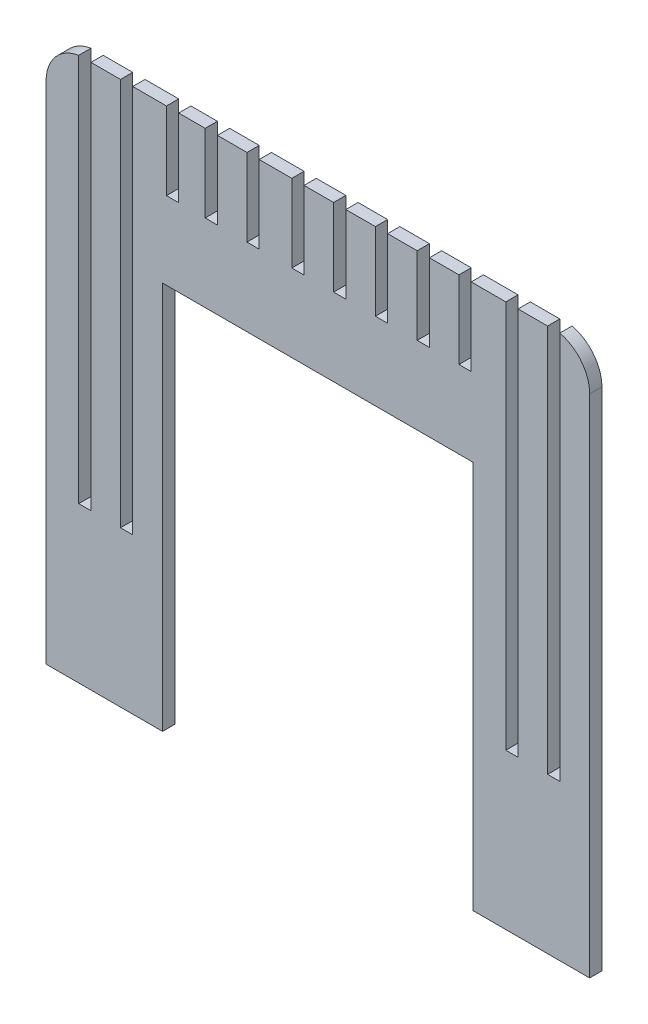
ISO-10303-21;
HEADER;
FILE_DESCRIPTION(('STEP AP214'),'2;1');
FILE_NAME('part.step','',(''),(''),'','','');
FILE_SCHEMA(('AUTOMOTIVE_DESIGN { 1 0 10303 214 1 1 1 1 }'));
ENDSEC;
DATA;
#1=APPLICATION_CONTEXT('core data for automotive mechanical design processes');
#2=APPLICATION_PROTOCOL_DEFINITION('international standard','automotive_design',2000,#1);
#3=PRODUCT_CONTEXT('',#1,'mechanical');
#4=PRODUCT('Part','Part','',(#3));
#5=PRODUCT_RELATED_PRODUCT_CATEGORY('part','',(#4));
#6=PRODUCT_DEFINITION_FORMATION('','',#4);
#7=PRODUCT_DEFINITION_CONTEXT('part definition',#1,'design');
#8=PRODUCT_DEFINITION('design','',#6,#7);
#9=PRODUCT_DEFINITION_SHAPE('','',#8);
#10=(LENGTH_UNIT() NAMED_UNIT(*) SI_UNIT(.MILLI.,.METRE.));
#11=(NAMED_UNIT(*) PLANE_ANGLE_UNIT() SI_UNIT($,.RADIAN.));
#12=(NAMED_UNIT(*) SI_UNIT($,.STERADIAN.) SOLID_ANGLE_UNIT());
#13=UNCERTAINTY_MEASURE_WITH_UNIT(LENGTH_MEASURE(1.E-05),#10,'distance_accuracy_value','');
#14=(GEOMETRIC_REPRESENTATION_CONTEXT(3) GLOBAL_UNCERTAINTY_ASSIGNED_CONTEXT((#13)) GLOBAL_UNIT_ASSIGNED_CONTEXT((#10,
#11,#12)) REPRESENTATION_CONTEXT('',''));
#15=CARTESIAN_POINT('',(0.,0.,0.));
#16=DIRECTION('',(0.,0.,1.));
#17=DIRECTION('',(1.,0.,0.));
#18=AXIS2_PLACEMENT_3D('',#15,#16,#17);
#19=CARTESIAN_POINT('',(-74.231999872,214.274734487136,4.000000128));
#20=DIRECTION('',(1.,0.,0.));
#21=DIRECTION('',(0.,1.,0.));
#22=AXIS2_PLACEMENT_3D('',#19,#20,#21);
#23=PLANE('',#22);
#24=DIRECTION('',(0.,-1.,0.));
#25=VECTOR('',#24,1.);
#26=CARTESIAN_POINT('',(-74.231999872,214.274734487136,0.));
#27=LINE('',#26,#25);
#28=CARTESIAN_POINT('',(-74.231999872,214.274734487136,0.));
#29=VERTEX_POINT('',#28);
#30=CARTESIAN_POINT('',(-74.231999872,87.2747344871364,0.));
#31=VERTEX_POINT('',#30);
#32=EDGE_CURVE('E409',#29,#31,#27,.T.);
#33=ORIENTED_EDGE('',*,*,#32,.T.);
#34=DIRECTION('',(0.,0.,-1.));
#35=VECTOR('',#34,1.);
#36=CARTESIAN_POINT('',(-74.231999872,87.2747344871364,4.000000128));
#37=LINE('',#36,#35);
#38=CARTESIAN_POINT('',(-74.231999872,87.2747344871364,4.000000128));
#39=VERTEX_POINT('',#38);
#40=EDGE_CURVE('E390',#39,#31,#37,.T.);
#41=ORIENTED_EDGE('',*,*,#40,.F.);
#42=DIRECTION('',(0.,-1.,0.));
#43=VECTOR('',#42,1.);
#44=CARTESIAN_POINT('',(-74.231999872,214.274734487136,4.000000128));
#45=LINE('',#44,#43);
#46=CARTESIAN_POINT('',(-74.231999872,214.274734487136,4.000000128));
#47=VERTEX_POINT('',#46);
#48=EDGE_CURVE('E397',#47,#39,#45,.T.);
#49=ORIENTED_EDGE('',*,*,#48,.F.);
#50=DIRECTION('',(0.,0.,-1.));
#51=VECTOR('',#50,1.);
#52=CARTESIAN_POINT('',(-74.231999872,214.274734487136,4.000000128));
#53=LINE('',#52,#51);
#54=EDGE_CURVE('E552',#47,#29,#53,.T.);
#55=ORIENTED_EDGE('',*,*,#54,.T.);
#56=EDGE_LOOP('',(#33,#41,#49,#55));
#57=FACE_BOUND('',#56,.T.);
#58=ADVANCED_FACE('F33',(#57),#23,.F.);
#59=CARTESIAN_POINT('',(-78.232,87.2747344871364,4.000000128));
#60=DIRECTION('',(0.,-1.,0.));
#61=DIRECTION('',(0.,0.,-1.));
#62=AXIS2_PLACEMENT_3D('',#59,#60,#61);
#63=PLANE('',#62);
#64=DIRECTION('',(-1.,0.,0.));
#65=VECTOR('',#64,1.);
#66=CARTESIAN_POINT('',(-78.232,87.2747344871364,0.));
#67=LINE('',#66,#65);
#68=CARTESIAN_POINT('',(-78.232,87.2747344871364,0.));
#69=VERTEX_POINT('',#68);
#70=EDGE_CURVE('E447',#31,#69,#67,.T.);
#71=ORIENTED_EDGE('',*,*,#70,.T.);
#72=DIRECTION('',(0.,0.,-1.));
#73=VECTOR('',#72,1.);
#74=CARTESIAN_POINT('',(-78.232,87.2747344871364,4.000000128));
#75=LINE('',#74,#73);
#76=CARTESIAN_POINT('',(-78.232,87.2747344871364,4.000000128));
#77=VERTEX_POINT('',#76);
#78=EDGE_CURVE('E393',#77,#69,#75,.T.);
#79=ORIENTED_EDGE('',*,*,#78,.F.);
#80=DIRECTION('',(-1.,0.,0.));
#81=VECTOR('',#80,1.);
#82=CARTESIAN_POINT('',(-78.232,87.2747344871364,4.000000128));
#83=LINE('',#82,#81);
#84=EDGE_CURVE('E386',#39,#77,#83,.T.);
#85=ORIENTED_EDGE('',*,*,#84,.F.);
#86=ORIENTED_EDGE('',*,*,#40,.T.);
#87=EDGE_LOOP('',(#71,#79,#85,#86));
#88=FACE_BOUND('',#87,.T.);
#89=ADVANCED_FACE('F388',(#88),#63,.F.);
#90=CARTESIAN_POINT('',(-78.232,214.274734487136,4.000000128));
#91=DIRECTION('',(-1.,0.,0.));
#92=DIRECTION('',(0.,-1.,0.));
#93=AXIS2_PLACEMENT_3D('',#90,#91,#92);
#94=PLANE('',#93);
#95=DIRECTION('',(0.,1.,0.));
#96=VECTOR('',#95,1.);
#97=CARTESIAN_POINT('',(-78.232,214.274734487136,0.));
#98=LINE('',#97,#96);
#99=CARTESIAN_POINT('',(-78.232,214.274734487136,0.));
#100=VERTEX_POINT('',#99);
#101=EDGE_CURVE('E442',#69,#100,#98,.T.);
#102=ORIENTED_EDGE('',*,*,#101,.T.);
#103=DIRECTION('',(0.,0.,-1.));
#104=VECTOR('',#103,1.);
#105=CARTESIAN_POINT('',(-78.232,214.274734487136,4.000000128));
#106=LINE('',#105,#104);
#107=CARTESIAN_POINT('',(-78.232,214.274734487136,4.000000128));
#108=VERTEX_POINT('',#107);
#109=EDGE_CURVE('E415',#108,#100,#106,.T.);
#110=ORIENTED_EDGE('',*,*,#109,.F.);
#111=DIRECTION('',(0.,1.,0.));
#112=VECTOR('',#111,1.);
#113=CARTESIAN_POINT('',(-78.232,214.274734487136,4.000000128));
#114=LINE('',#113,#112);
#115=EDGE_CURVE('E396',#77,#108,#114,.T.);
#116=ORIENTED_EDGE('',*,*,#115,.F.);
#117=ORIENTED_EDGE('',*,*,#78,.T.);
#118=EDGE_LOOP('',(#102,#110,#116,#117));
#119=FACE_BOUND('',#118,.T.);
#120=ADVANCED_FACE('F446',(#119),#94,.F.);
#121=CARTESIAN_POINT('',(-88.9,36.4747344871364,4.000000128));
#122=DIRECTION('',(1.,0.,0.));
#123=DIRECTION('',(0.,0.,-1.));
#124=AXIS2_PLACEMENT_3D('',#121,#122,#123);
#125=PLANE('',#124);
#126=DIRECTION('',(0.,-1.,0.));
#127=VECTOR('',#126,1.);
#128=CARTESIAN_POINT('',(-88.9,36.4747344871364,4.000000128));
#129=LINE('',#128,#127);
#130=CARTESIAN_POINT('',(-88.9,201.738348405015,4.000000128));
#131=VERTEX_POINT('',#130);
#132=CARTESIAN_POINT('',(-88.9,36.4747344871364,4.000000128));
#133=VERTEX_POINT('',#132);
#134=EDGE_CURVE('E424',#131,#133,#129,.T.);
#135=ORIENTED_EDGE('',*,*,#134,.F.);
#136=DIRECTION('',(0.,0.,-1.));
#137=VECTOR('',#136,1.);
#138=CARTESIAN_POINT('',(-88.9,201.738348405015,4.000000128));
#139=LINE('',#138,#137);
#140=CARTESIAN_POINT('',(-88.9,201.738348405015,0.));
#141=VERTEX_POINT('',#140);
#142=EDGE_CURVE('E410',#131,#141,#139,.T.);
#143=ORIENTED_EDGE('',*,*,#142,.T.);
#144=DIRECTION('',(0.,-1.,0.));
#145=VECTOR('',#144,1.);
#146=CARTESIAN_POINT('',(-88.9,36.4747344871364,0.));
#147=LINE('',#146,#145);
#148=CARTESIAN_POINT('',(-88.9,36.4747344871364,0.));
#149=VERTEX_POINT('',#148);
#150=EDGE_CURVE('E444',#141,#149,#147,.T.);
#151=ORIENTED_EDGE('',*,*,#150,.T.);
#152=DIRECTION('',(0.,0.,-1.));
#153=VECTOR('',#152,1.);
#154=CARTESIAN_POINT('',(-88.9,36.4747344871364,4.000000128));
#155=LINE('',#154,#153);
#156=EDGE_CURVE('E434',#133,#149,#155,.T.);
#157=ORIENTED_EDGE('',*,*,#156,.F.);
#158=EDGE_LOOP('',(#135,#143,#151,#157));
#159=FACE_BOUND('',#158,.T.);
#160=ADVANCED_FACE('F431',(#159),#125,.F.);
#161=CARTESIAN_POINT('',(-50.8,36.4747344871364,4.000000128));
#162=DIRECTION('',(0.,1.,0.));
#163=DIRECTION('',(0.,0.,1.));
#164=AXIS2_PLACEMENT_3D('',#161,#162,#163);
#165=PLANE('',#164);
#166=DIRECTION('',(1.,0.,0.));
#167=VECTOR('',#166,1.);
#168=CARTESIAN_POINT('',(-50.8,36.4747344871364,0.));
#169=LINE('',#168,#167);
#170=CARTESIAN_POINT('',(-50.8,36.4747344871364,0.));
#171=VERTEX_POINT('',#170);
#172=EDGE_CURVE('E449',#149,#171,#169,.T.);
#173=ORIENTED_EDGE('',*,*,#172,.T.);
#174=DIRECTION('',(0.,0.,-1.));
#175=VECTOR('',#174,1.);
#176=CARTESIAN_POINT('',(-50.8,36.4747344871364,4.000000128));
#177=LINE('',#176,#175);
#178=CARTESIAN_POINT('',(-50.8,36.4747344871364,4.000000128));
#179=VERTEX_POINT('',#178);
#180=EDGE_CURVE('E698',#179,#171,#177,.T.);
#181=ORIENTED_EDGE('',*,*,#180,.F.);
#182=DIRECTION('',(1.,0.,0.));
#183=VECTOR('',#182,1.);
#184=CARTESIAN_POINT('',(-50.8,36.4747344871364,4.000000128));
#185=LINE('',#184,#183);
#186=EDGE_CURVE('E436',#133,#179,#185,.T.);
#187=ORIENTED_EDGE('',*,*,#186,.F.);
#188=ORIENTED_EDGE('',*,*,#156,.T.);
#189=EDGE_LOOP('',(#173,#181,#187,#188));
#190=FACE_BOUND('',#189,.T.);
#191=ADVANCED_FACE('F702',(#190),#165,.F.);
#192=CARTESIAN_POINT('',(-50.8,36.4747344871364,4.000000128));
#193=DIRECTION('',(-1.,0.,0.));
#194=DIRECTION('',(0.,0.,1.));
#195=AXIS2_PLACEMENT_3D('',#192,#193,#194);
#196=PLANE('',#195);
#197=DIRECTION('',(0.,1.,0.));
#198=VECTOR('',#197,1.);
#199=CARTESIAN_POINT('',(-50.8,36.4747344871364,0.));
#200=LINE('',#199,#198);
#201=CARTESIAN_POINT('',(-50.8,163.474734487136,0.));
#202=VERTEX_POINT('',#201);
#203=EDGE_CURVE('E455',#171,#202,#200,.T.);
#204=ORIENTED_EDGE('',*,*,#203,.T.);
#205=DIRECTION('',(0.,0.,-1.));
#206=VECTOR('',#205,1.);
#207=CARTESIAN_POINT('',(-50.8,163.474734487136,4.000000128));
#208=LINE('',#207,#206);
#209=CARTESIAN_POINT('',(-50.8,163.474734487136,4.000000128));
#210=VERTEX_POINT('',#209);
#211=EDGE_CURVE('E695',#210,#202,#208,.T.);
#212=ORIENTED_EDGE('',*,*,#211,.F.);
#213=DIRECTION('',(0.,1.,0.));
#214=VECTOR('',#213,1.);
#215=CARTESIAN_POINT('',(-50.8,36.4747344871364,4.000000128));
#216=LINE('',#215,#214);
#217=EDGE_CURVE('E718',#179,#210,#216,.T.);
#218=ORIENTED_EDGE('',*,*,#217,.F.);
#219=ORIENTED_EDGE('',*,*,#180,.T.);
#220=EDGE_LOOP('',(#204,#212,#218,#219));
#221=FACE_BOUND('',#220,.T.);
#222=ADVANCED_FACE('F709',(#221),#196,.F.);
#223=CARTESIAN_POINT('',(-50.8,163.474734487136,4.000000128));
#224=DIRECTION('',(0.,1.,0.));
#225=DIRECTION('',(0.,0.,1.));
#226=AXIS2_PLACEMENT_3D('',#223,#224,#225);
#227=PLANE('',#226);
#228=DIRECTION('',(1.,0.,0.));
#229=VECTOR('',#228,1.);
#230=CARTESIAN_POINT('',(-50.8,163.474734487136,0.));
#231=LINE('',#230,#229);
#232=CARTESIAN_POINT('',(50.8,163.474734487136,0.));
#233=VERTEX_POINT('',#232);
#234=EDGE_CURVE('E457',#202,#233,#231,.T.);
#235=ORIENTED_EDGE('',*,*,#234,.T.);
#236=DIRECTION('',(0.,0.,-1.));
#237=VECTOR('',#236,1.);
#238=CARTESIAN_POINT('',(50.8,163.474734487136,4.000000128));
#239=LINE('',#238,#237);
#240=CARTESIAN_POINT('',(50.8,163.474734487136,4.000000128));
#241=VERTEX_POINT('',#240);
#242=EDGE_CURVE('E692',#241,#233,#239,.T.);
#243=ORIENTED_EDGE('',*,*,#242,.F.);
#244=DIRECTION('',(1.,0.,0.));
#245=VECTOR('',#244,1.);
#246=CARTESIAN_POINT('',(-50.8,163.474734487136,4.000000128));
#247=LINE('',#246,#245);
#248=EDGE_CURVE('E715',#210,#241,#247,.T.);
#249=ORIENTED_EDGE('',*,*,#248,.F.);
#250=ORIENTED_EDGE('',*,*,#211,.T.);
#251=EDGE_LOOP('',(#235,#243,#249,#250));
#252=FACE_BOUND('',#251,.T.);
#253=ADVANCED_FACE('F713',(#252),#227,.F.);
#254=CARTESIAN_POINT('',(50.8,163.474734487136,4.000000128));
#255=DIRECTION('',(1.,0.,0.));
#256=DIRECTION('',(0.,1.,0.));
#257=AXIS2_PLACEMENT_3D('',#254,#255,#256);
#258=PLANE('',#257);
#259=DIRECTION('',(0.,-1.,0.));
#260=VECTOR('',#259,1.);
#261=CARTESIAN_POINT('',(50.8,163.474734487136,0.));
#262=LINE('',#261,#260);
#263=CARTESIAN_POINT('',(50.8,36.4747344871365,0.));
#264=VERTEX_POINT('',#263);
#265=EDGE_CURVE('E459',#233,#264,#262,.T.);
#266=ORIENTED_EDGE('',*,*,#265,.T.);
#267=DIRECTION('',(0.,0.,-1.));
#268=VECTOR('',#267,1.);
#269=CARTESIAN_POINT('',(50.8,36.4747344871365,4.000000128));
#270=LINE('',#269,#268);
#271=CARTESIAN_POINT('',(50.8,36.4747344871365,4.000000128));
#272=VERTEX_POINT('',#271);
#273=EDGE_CURVE('E689',#272,#264,#270,.T.);
#274=ORIENTED_EDGE('',*,*,#273,.F.);
#275=DIRECTION('',(0.,-1.,0.));
#276=VECTOR('',#275,1.);
#277=CARTESIAN_POINT('',(50.8,163.474734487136,4.000000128));
#278=LINE('',#277,#276);
#279=EDGE_CURVE('E717',#241,#272,#278,.T.);
#280=ORIENTED_EDGE('',*,*,#279,.F.);
#281=ORIENTED_EDGE('',*,*,#242,.T.);
#282=EDGE_LOOP('',(#266,#274,#280,#281));
#283=FACE_BOUND('',#282,.T.);
#284=ADVANCED_FACE('F1042',(#283),#258,.F.);
#285=CARTESIAN_POINT('',(50.8,36.4747344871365,4.000000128));
#286=DIRECTION('',(0.,1.,0.));
#287=DIRECTION('',(-1.,0.,0.));
#288=AXIS2_PLACEMENT_3D('',#285,#286,#287);
#289=PLANE('',#288);
#290=DIRECTION('',(1.,0.,0.));
#291=VECTOR('',#290,1.);
#292=CARTESIAN_POINT('',(50.8,36.4747344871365,0.));
#293=LINE('',#292,#291);
#294=CARTESIAN_POINT('',(88.9,36.4747344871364,0.));
#295=VERTEX_POINT('',#294);
#296=EDGE_CURVE('E461',#264,#295,#293,.T.);
#297=ORIENTED_EDGE('',*,*,#296,.T.);
#298=DIRECTION('',(0.,0.,-1.));
#299=VECTOR('',#298,1.);
#300=CARTESIAN_POINT('',(88.9,36.4747344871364,4.000000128));
#301=LINE('',#300,#299);
#302=CARTESIAN_POINT('',(88.9,36.4747344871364,4.000000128));
#303=VERTEX_POINT('',#302);
#304=EDGE_CURVE('E686',#303,#295,#301,.T.);
#305=ORIENTED_EDGE('',*,*,#304,.F.);
#306=DIRECTION('',(1.,0.,0.));
#307=VECTOR('',#306,1.);
#308=CARTESIAN_POINT('',(50.8,36.4747344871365,4.000000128));
#309=LINE('',#308,#307);
#310=EDGE_CURVE('E720',#272,#303,#309,.T.);
#311=ORIENTED_EDGE('',*,*,#310,.F.);
#312=ORIENTED_EDGE('',*,*,#273,.T.);
#313=EDGE_LOOP('',(#297,#305,#311,#312));
#314=FACE_BOUND('',#313,.T.);
#315=ADVANCED_FACE('F1039',(#314),#289,.F.);
#316=CARTESIAN_POINT('',(88.9,36.4747344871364,4.000000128));
#317=DIRECTION('',(-1.,0.,0.));
#318=DIRECTION('',(0.,0.,1.));
#319=AXIS2_PLACEMENT_3D('',#316,#317,#318);
#320=PLANE('',#319);
#321=DIRECTION('',(0.,1.,0.));
#322=VECTOR('',#321,1.);
#323=CARTESIAN_POINT('',(88.9,36.4747344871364,0.));
#324=LINE('',#323,#322);
#325=CARTESIAN_POINT('',(88.9,201.918768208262,0.));
#326=VERTEX_POINT('',#325);
#327=EDGE_CURVE('E463',#295,#326,#324,.T.);
#328=ORIENTED_EDGE('',*,*,#327,.T.);
#329=DIRECTION('',(0.,0.,1.));
#330=VECTOR('',#329,1.);
#331=CARTESIAN_POINT('',(88.9,201.918768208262,4.000000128));
#332=LINE('',#331,#330);
#333=CARTESIAN_POINT('',(88.9,201.918768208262,4.000000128));
#334=VERTEX_POINT('',#333);
#335=EDGE_CURVE('E41',#326,#334,#332,.T.);
#336=ORIENTED_EDGE('',*,*,#335,.T.);
#337=DIRECTION('',(0.,1.,0.));
#338=VECTOR('',#337,1.);
#339=CARTESIAN_POINT('',(88.9,36.4747344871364,4.000000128));
#340=LINE('',#339,#338);
#341=EDGE_CURVE('E726',#303,#334,#340,.T.);
#342=ORIENTED_EDGE('',*,*,#341,.F.);
#343=ORIENTED_EDGE('',*,*,#304,.T.);
#344=EDGE_LOOP('',(#328,#336,#342,#343));
#345=FACE_BOUND('',#344,.T.);
#346=ADVANCED_FACE('F1036',(#345),#320,.F.);
#347=CARTESIAN_POINT('',(79.136000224,214.274734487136,4.000000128));
#348=DIRECTION('',(1.,0.,0.));
#349=DIRECTION('',(0.,1.,0.));
#350=AXIS2_PLACEMENT_3D('',#347,#348,#349);
#351=PLANE('',#350);
#352=DIRECTION('',(0.,-1.,0.));
#353=VECTOR('',#352,1.);
#354=CARTESIAN_POINT('',(79.136000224,214.274734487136,0.));
#355=LINE('',#354,#353);
#356=CARTESIAN_POINT('',(79.136000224,214.274734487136,0.));
#357=VERTEX_POINT('',#356);
#358=CARTESIAN_POINT('',(79.136000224,87.2747344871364,0.));
#359=VERTEX_POINT('',#358);
#360=EDGE_CURVE('E465',#357,#359,#355,.T.);
#361=ORIENTED_EDGE('',*,*,#360,.T.);
#362=DIRECTION('',(0.,0.,-1.));
#363=VECTOR('',#362,1.);
#364=CARTESIAN_POINT('',(79.136000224,87.2747344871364,4.000000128));
#365=LINE('',#364,#363);
#366=CARTESIAN_POINT('',(79.136000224,87.2747344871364,4.000000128));
#367=VERTEX_POINT('',#366);
#368=EDGE_CURVE('E680',#367,#359,#365,.T.);
#369=ORIENTED_EDGE('',*,*,#368,.F.);
#370=DIRECTION('',(0.,-1.,0.));
#371=VECTOR('',#370,1.);
#372=CARTESIAN_POINT('',(79.136000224,214.274734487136,4.000000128));
#373=LINE('',#372,#371);
#374=CARTESIAN_POINT('',(79.136000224,214.274734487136,4.000000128));
#375=VERTEX_POINT('',#374);
#376=EDGE_CURVE('E728',#375,#367,#373,.T.);
#377=ORIENTED_EDGE('',*,*,#376,.F.);
#378=DIRECTION('',(0.,0.,-1.));
#379=VECTOR('',#378,1.);
#380=CARTESIAN_POINT('',(79.136000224,214.274734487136,4.000000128));
#381=LINE('',#380,#379);
#382=EDGE_CURVE('E683',#375,#357,#381,.T.);
#383=ORIENTED_EDGE('',*,*,#382,.T.);
#384=EDGE_LOOP('',(#361,#369,#377,#383));
#385=FACE_BOUND('',#384,.T.);
#386=ADVANCED_FACE('F1030',(#385),#351,.F.);
#387=CARTESIAN_POINT('',(75.136000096,87.2747344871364,4.000000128));
#388=DIRECTION('',(0.,-1.,0.));
#389=DIRECTION('',(0.,0.,-1.));
#390=AXIS2_PLACEMENT_3D('',#387,#388,#389);
#391=PLANE('',#390);
#392=DIRECTION('',(-1.,0.,0.));
#393=VECTOR('',#392,1.);
#394=CARTESIAN_POINT('',(75.136000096,87.2747344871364,0.));
#395=LINE('',#394,#393);
#396=CARTESIAN_POINT('',(75.136000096,87.2747344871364,0.));
#397=VERTEX_POINT('',#396);
#398=EDGE_CURVE('E467',#359,#397,#395,.T.);
#399=ORIENTED_EDGE('',*,*,#398,.T.);
#400=DIRECTION('',(0.,0.,-1.));
#401=VECTOR('',#400,1.);
#402=CARTESIAN_POINT('',(75.136000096,87.2747344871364,4.000000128));
#403=LINE('',#402,#401);
#404=CARTESIAN_POINT('',(75.136000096,87.2747344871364,4.000000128));
#405=VERTEX_POINT('',#404);
#406=EDGE_CURVE('E677',#405,#397,#403,.T.);
#407=ORIENTED_EDGE('',*,*,#406,.F.);
#408=DIRECTION('',(-1.,0.,0.));
#409=VECTOR('',#408,1.);
#410=CARTESIAN_POINT('',(75.136000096,87.2747344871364,4.000000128));
#411=LINE('',#410,#409);
#412=EDGE_CURVE('E730',#367,#405,#411,.T.);
#413=ORIENTED_EDGE('',*,*,#412,.F.);
#414=ORIENTED_EDGE('',*,*,#368,.T.);
#415=EDGE_LOOP('',(#399,#407,#413,#414));
#416=FACE_BOUND('',#415,.T.);
#417=ADVANCED_FACE('F1026',(#416),#391,.F.);
#418=CARTESIAN_POINT('',(75.136000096,214.274734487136,4.000000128));
#419=DIRECTION('',(-1.,0.,0.));
#420=DIRECTION('',(0.,-1.,0.));
#421=AXIS2_PLACEMENT_3D('',#418,#419,#420);
#422=PLANE('',#421);
#423=DIRECTION('',(0.,1.,0.));
#424=VECTOR('',#423,1.);
#425=CARTESIAN_POINT('',(75.136000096,214.274734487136,0.));
#426=LINE('',#425,#424);
#427=CARTESIAN_POINT('',(75.136000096,214.274734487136,0.));
#428=VERTEX_POINT('',#427);
#429=EDGE_CURVE('E469',#397,#428,#426,.T.);
#430=ORIENTED_EDGE('',*,*,#429,.T.);
#431=DIRECTION('',(0.,0.,-1.));
#432=VECTOR('',#431,1.);
#433=CARTESIAN_POINT('',(75.136000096,214.274734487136,4.000000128));
#434=LINE('',#433,#432);
#435=CARTESIAN_POINT('',(75.136000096,214.274734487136,4.000000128));
#436=VERTEX_POINT('',#435);
#437=EDGE_CURVE('E674',#436,#428,#434,.T.);
#438=ORIENTED_EDGE('',*,*,#437,.F.);
#439=DIRECTION('',(0.,1.,0.));
#440=VECTOR('',#439,1.);
#441=CARTESIAN_POINT('',(75.136000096,214.274734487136,4.000000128));
#442=LINE('',#441,#440);
#443=EDGE_CURVE('E732',#405,#436,#442,.T.);
#444=ORIENTED_EDGE('',*,*,#443,.F.);
#445=ORIENTED_EDGE('',*,*,#406,.T.);
#446=EDGE_LOOP('',(#430,#438,#444,#445));
#447=FACE_BOUND('',#446,.T.);
#448=ADVANCED_FACE('F1021',(#447),#422,.F.);
#449=CARTESIAN_POINT('',(65.468000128,214.274734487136,4.000000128));
#450=DIRECTION('',(0.,-1.,0.));
#451=DIRECTION('',(0.,0.,-1.));
#452=AXIS2_PLACEMENT_3D('',#449,#450,#451);
#453=PLANE('',#452);
#454=DIRECTION('',(-1.,0.,0.));
#455=VECTOR('',#454,1.);
#456=CARTESIAN_POINT('',(65.468000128,214.274734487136,0.));
#457=LINE('',#456,#455);
#458=CARTESIAN_POINT('',(65.468000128,214.274734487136,0.));
#459=VERTEX_POINT('',#458);
#460=EDGE_CURVE('E471',#428,#459,#457,.T.);
#461=ORIENTED_EDGE('',*,*,#460,.T.);
#462=DIRECTION('',(0.,0.,-1.));
#463=VECTOR('',#462,1.);
#464=CARTESIAN_POINT('',(65.468000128,214.274734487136,4.000000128));
#465=LINE('',#464,#463);
#466=CARTESIAN_POINT('',(65.468000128,214.274734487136,4.000000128));
#467=VERTEX_POINT('',#466);
#468=EDGE_CURVE('E671',#467,#459,#465,.T.);
#469=ORIENTED_EDGE('',*,*,#468,.F.);
#470=DIRECTION('',(-1.,0.,0.));
#471=VECTOR('',#470,1.);
#472=CARTESIAN_POINT('',(65.468000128,214.274734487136,4.000000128));
#473=LINE('',#472,#471);
#474=EDGE_CURVE('E734',#436,#467,#473,.T.);
#475=ORIENTED_EDGE('',*,*,#474,.F.);
#476=ORIENTED_EDGE('',*,*,#437,.T.);
#477=EDGE_LOOP('',(#461,#469,#475,#476));
#478=FACE_BOUND('',#477,.T.);
#479=ADVANCED_FACE('F1016',(#478),#453,.F.);
#480=CARTESIAN_POINT('',(65.468000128,214.274734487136,4.000000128));
#481=DIRECTION('',(1.,0.,0.));
#482=DIRECTION('',(0.,1.,0.));
#483=AXIS2_PLACEMENT_3D('',#480,#481,#482);
#484=PLANE('',#483);
#485=DIRECTION('',(0.,-1.,0.));
#486=VECTOR('',#485,1.);
#487=CARTESIAN_POINT('',(65.468000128,214.274734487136,0.));
#488=LINE('',#487,#486);
#489=CARTESIAN_POINT('',(65.468000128,87.2747344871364,0.));
#490=VERTEX_POINT('',#489);
#491=EDGE_CURVE('E473',#459,#490,#488,.T.);
#492=ORIENTED_EDGE('',*,*,#491,.T.);
#493=DIRECTION('',(0.,0.,-1.));
#494=VECTOR('',#493,1.);
#495=CARTESIAN_POINT('',(65.468000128,87.2747344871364,4.000000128));
#496=LINE('',#495,#494);
#497=CARTESIAN_POINT('',(65.468000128,87.2747344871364,4.000000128));
#498=VERTEX_POINT('',#497);
#499=EDGE_CURVE('E668',#498,#490,#496,.T.);
#500=ORIENTED_EDGE('',*,*,#499,.F.);
#501=DIRECTION('',(0.,-1.,0.));
#502=VECTOR('',#501,1.);
#503=CARTESIAN_POINT('',(65.468000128,214.274734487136,4.000000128));
#504=LINE('',#503,#502);
#505=EDGE_CURVE('E736',#467,#498,#504,.T.);
#506=ORIENTED_EDGE('',*,*,#505,.F.);
#507=ORIENTED_EDGE('',*,*,#468,.T.);
#508=EDGE_LOOP('',(#492,#500,#506,#507));
#509=FACE_BOUND('',#508,.T.);
#510=ADVANCED_FACE('F1012',(#509),#484,.F.);
#511=CARTESIAN_POINT('',(61.468,87.2747344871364,4.000000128));
#512=DIRECTION('',(0.,-1.,0.));
#513=DIRECTION('',(0.,0.,-1.));
#514=AXIS2_PLACEMENT_3D('',#511,#512,#513);
#515=PLANE('',#514);
#516=DIRECTION('',(-1.,0.,0.));
#517=VECTOR('',#516,1.);
#518=CARTESIAN_POINT('',(61.468,87.2747344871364,0.));
#519=LINE('',#518,#517);
#520=CARTESIAN_POINT('',(61.468,87.2747344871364,0.));
#521=VERTEX_POINT('',#520);
#522=EDGE_CURVE('E475',#490,#521,#519,.T.);
#523=ORIENTED_EDGE('',*,*,#522,.T.);
#524=DIRECTION('',(0.,0.,-1.));
#525=VECTOR('',#524,1.);
#526=CARTESIAN_POINT('',(61.468,87.2747344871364,4.000000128));
#527=LINE('',#526,#525);
#528=CARTESIAN_POINT('',(61.468,87.2747344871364,4.000000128));
#529=VERTEX_POINT('',#528);
#530=EDGE_CURVE('E665',#529,#521,#527,.T.);
#531=ORIENTED_EDGE('',*,*,#530,.F.);
#532=DIRECTION('',(-1.,0.,0.));
#533=VECTOR('',#532,1.);
#534=CARTESIAN_POINT('',(61.468,87.2747344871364,4.000000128));
#535=LINE('',#534,#533);
#536=EDGE_CURVE('E738',#498,#529,#535,.T.);
#537=ORIENTED_EDGE('',*,*,#536,.F.);
#538=ORIENTED_EDGE('',*,*,#499,.T.);
#539=EDGE_LOOP('',(#523,#531,#537,#538));
#540=FACE_BOUND('',#539,.T.);
#541=ADVANCED_FACE('F1007',(#540),#515,.F.);
#542=CARTESIAN_POINT('',(61.468,214.274734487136,4.000000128));
#543=DIRECTION('',(-1.,0.,0.));
#544=DIRECTION('',(0.,-1.,0.));
#545=AXIS2_PLACEMENT_3D('',#542,#543,#544);
#546=PLANE('',#545);
#547=DIRECTION('',(0.,1.,0.));
#548=VECTOR('',#547,1.);
#549=CARTESIAN_POINT('',(61.468,214.274734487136,0.));
#550=LINE('',#549,#548);
#551=CARTESIAN_POINT('',(61.468,214.274734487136,0.));
#552=VERTEX_POINT('',#551);
#553=EDGE_CURVE('E477',#521,#552,#550,.T.);
#554=ORIENTED_EDGE('',*,*,#553,.T.);
#555=DIRECTION('',(0.,0.,-1.));
#556=VECTOR('',#555,1.);
#557=CARTESIAN_POINT('',(61.468,214.274734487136,4.000000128));
#558=LINE('',#557,#556);
#559=CARTESIAN_POINT('',(61.468,214.274734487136,4.000000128));
#560=VERTEX_POINT('',#559);
#561=EDGE_CURVE('E662',#560,#552,#558,.T.);
#562=ORIENTED_EDGE('',*,*,#561,.F.);
#563=DIRECTION('',(0.,1.,0.));
#564=VECTOR('',#563,1.);
#565=CARTESIAN_POINT('',(61.468,214.274734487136,4.000000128));
#566=LINE('',#565,#564);
#567=EDGE_CURVE('E740',#529,#560,#566,.T.);
#568=ORIENTED_EDGE('',*,*,#567,.F.);
#569=ORIENTED_EDGE('',*,*,#530,.T.);
#570=EDGE_LOOP('',(#554,#562,#568,#569));
#571=FACE_BOUND('',#570,.T.);
#572=ADVANCED_FACE('F1001',(#571),#546,.F.);
#573=CARTESIAN_POINT('',(50.1460008,214.274734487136,4.000000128));
#574=DIRECTION('',(0.,-1.,0.));
#575=DIRECTION('',(0.,0.,-1.));
#576=AXIS2_PLACEMENT_3D('',#573,#574,#575);
#577=PLANE('',#576);
#578=DIRECTION('',(-1.,0.,0.));
#579=VECTOR('',#578,1.);
#580=CARTESIAN_POINT('',(50.1460008,214.274734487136,0.));
#581=LINE('',#580,#579);
#582=CARTESIAN_POINT('',(50.1460008,214.274734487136,0.));
#583=VERTEX_POINT('',#582);
#584=EDGE_CURVE('E479',#552,#583,#581,.T.);
#585=ORIENTED_EDGE('',*,*,#584,.T.);
#586=DIRECTION('',(0.,0.,-1.));
#587=VECTOR('',#586,1.);
#588=CARTESIAN_POINT('',(50.1460008,214.274734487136,4.000000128));
#589=LINE('',#588,#587);
#590=CARTESIAN_POINT('',(50.1460008,214.274734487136,4.000000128));
#591=VERTEX_POINT('',#590);
#592=EDGE_CURVE('E659',#591,#583,#589,.T.);
#593=ORIENTED_EDGE('',*,*,#592,.F.);
#594=DIRECTION('',(-1.,0.,0.));
#595=VECTOR('',#594,1.);
#596=CARTESIAN_POINT('',(50.1460008,214.274734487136,4.000000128));
#597=LINE('',#596,#595);
#598=EDGE_CURVE('E742',#560,#591,#597,.T.);
#599=ORIENTED_EDGE('',*,*,#598,.F.);
#600=ORIENTED_EDGE('',*,*,#561,.T.);
#601=EDGE_LOOP('',(#585,#593,#599,#600));
#602=FACE_BOUND('',#601,.T.);
#603=ADVANCED_FACE('F997',(#602),#577,.F.);
#604=CARTESIAN_POINT('',(50.1460008,214.274734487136,4.000000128));
#605=DIRECTION('',(1.,0.,0.));
#606=DIRECTION('',(0.,1.,0.));
#607=AXIS2_PLACEMENT_3D('',#604,#605,#606);
#608=PLANE('',#607);
#609=DIRECTION('',(0.,-1.,0.));
#610=VECTOR('',#609,1.);
#611=CARTESIAN_POINT('',(50.1460008,214.274734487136,0.));
#612=LINE('',#611,#610);
#613=CARTESIAN_POINT('',(50.1460008,188.874734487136,0.));
#614=VERTEX_POINT('',#613);
#615=EDGE_CURVE('E481',#583,#614,#612,.T.);
#616=ORIENTED_EDGE('',*,*,#615,.T.);
#617=DIRECTION('',(0.,0.,-1.));
#618=VECTOR('',#617,1.);
#619=CARTESIAN_POINT('',(50.1460008,188.874734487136,4.000000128));
#620=LINE('',#619,#618);
#621=CARTESIAN_POINT('',(50.1460008,188.874734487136,4.000000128));
#622=VERTEX_POINT('',#621);
#623=EDGE_CURVE('E656',#622,#614,#620,.T.);
#624=ORIENTED_EDGE('',*,*,#623,.F.);
#625=DIRECTION('',(0.,-1.,0.));
#626=VECTOR('',#625,1.);
#627=CARTESIAN_POINT('',(50.1460008,214.274734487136,4.000000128));
#628=LINE('',#627,#626);
#629=EDGE_CURVE('E744',#591,#622,#628,.T.);
#630=ORIENTED_EDGE('',*,*,#629,.F.);
#631=ORIENTED_EDGE('',*,*,#592,.T.);
#632=EDGE_LOOP('',(#616,#624,#630,#631));
#633=FACE_BOUND('',#632,.T.);
#634=ADVANCED_FACE('F992',(#633),#608,.F.);
#635=CARTESIAN_POINT('',(46.146000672,188.874734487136,4.000000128));
#636=DIRECTION('',(0.,-1.,0.));
#637=DIRECTION('',(0.,0.,-1.));
#638=AXIS2_PLACEMENT_3D('',#635,#636,#637);
#639=PLANE('',#638);
#640=DIRECTION('',(-1.,0.,0.));
#641=VECTOR('',#640,1.);
#642=CARTESIAN_POINT('',(46.146000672,188.874734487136,0.));
#643=LINE('',#642,#641);
#644=CARTESIAN_POINT('',(46.146000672,188.874734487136,0.));
#645=VERTEX_POINT('',#644);
#646=EDGE_CURVE('E483',#614,#645,#643,.T.);
#647=ORIENTED_EDGE('',*,*,#646,.T.);
#648=DIRECTION('',(0.,0.,-1.));
#649=VECTOR('',#648,1.);
#650=CARTESIAN_POINT('',(46.146000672,188.874734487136,4.000000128));
#651=LINE('',#650,#649);
#652=CARTESIAN_POINT('',(46.146000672,188.874734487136,4.000000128));
#653=VERTEX_POINT('',#652);
#654=EDGE_CURVE('E653',#653,#645,#651,.T.);
#655=ORIENTED_EDGE('',*,*,#654,.F.);
#656=DIRECTION('',(-1.,0.,0.));
#657=VECTOR('',#656,1.);
#658=CARTESIAN_POINT('',(46.146000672,188.874734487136,4.000000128));
#659=LINE('',#658,#657);
#660=EDGE_CURVE('E746',#622,#653,#659,.T.);
#661=ORIENTED_EDGE('',*,*,#660,.F.);
#662=ORIENTED_EDGE('',*,*,#623,.T.);
#663=EDGE_LOOP('',(#647,#655,#661,#662));
#664=FACE_BOUND('',#663,.T.);
#665=ADVANCED_FACE('F986',(#664),#639,.F.);
#666=CARTESIAN_POINT('',(46.146000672,214.274734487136,4.000000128));
#667=DIRECTION('',(-1.,0.,0.));
#668=DIRECTION('',(0.,0.,1.));
#669=AXIS2_PLACEMENT_3D('',#666,#667,#668);
#670=PLANE('',#669);
#671=DIRECTION('',(0.,1.,0.));
#672=VECTOR('',#671,1.);
#673=CARTESIAN_POINT('',(46.146000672,214.274734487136,0.));
#674=LINE('',#673,#672);
#675=CARTESIAN_POINT('',(46.146000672,214.274734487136,0.));
#676=VERTEX_POINT('',#675);
#677=EDGE_CURVE('E485',#645,#676,#674,.T.);
#678=ORIENTED_EDGE('',*,*,#677,.T.);
#679=DIRECTION('',(0.,0.,-1.));
#680=VECTOR('',#679,1.);
#681=CARTESIAN_POINT('',(46.146000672,214.274734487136,4.000000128));
#682=LINE('',#681,#680);
#683=CARTESIAN_POINT('',(46.146000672,214.274734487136,4.000000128));
#684=VERTEX_POINT('',#683);
#685=EDGE_CURVE('E650',#684,#676,#682,.T.);
#686=ORIENTED_EDGE('',*,*,#685,.F.);
#687=DIRECTION('',(0.,1.,0.));
#688=VECTOR('',#687,1.);
#689=CARTESIAN_POINT('',(46.146000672,214.274734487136,4.000000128));
#690=LINE('',#689,#688);
#691=EDGE_CURVE('E748',#653,#684,#690,.T.);
#692=ORIENTED_EDGE('',*,*,#691,.F.);
#693=ORIENTED_EDGE('',*,*,#654,.T.);
#694=EDGE_LOOP('',(#678,#686,#692,#693));
#695=FACE_BOUND('',#694,.T.);
#696=ADVANCED_FACE('F982',(#695),#670,.F.);
#697=CARTESIAN_POINT('',(36.478000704,214.274734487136,4.000000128));
#698=DIRECTION('',(0.,-1.,0.));
#699=DIRECTION('',(0.,0.,-1.));
#700=AXIS2_PLACEMENT_3D('',#697,#698,#699);
#701=PLANE('',#700);
#702=DIRECTION('',(-1.,0.,0.));
#703=VECTOR('',#702,1.);
#704=CARTESIAN_POINT('',(36.478000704,214.274734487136,0.));
#705=LINE('',#704,#703);
#706=CARTESIAN_POINT('',(36.478000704,214.274734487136,0.));
#707=VERTEX_POINT('',#706);
#708=EDGE_CURVE('E487',#676,#707,#705,.T.);
#709=ORIENTED_EDGE('',*,*,#708,.T.);
#710=DIRECTION('',(0.,0.,-1.));
#711=VECTOR('',#710,1.);
#712=CARTESIAN_POINT('',(36.478000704,214.274734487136,4.000000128));
#713=LINE('',#712,#711);
#714=CARTESIAN_POINT('',(36.478000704,214.274734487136,4.000000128));
#715=VERTEX_POINT('',#714);
#716=EDGE_CURVE('E647',#715,#707,#713,.T.);
#717=ORIENTED_EDGE('',*,*,#716,.F.);
#718=DIRECTION('',(-1.,0.,0.));
#719=VECTOR('',#718,1.);
#720=CARTESIAN_POINT('',(36.478000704,214.274734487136,4.000000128));
#721=LINE('',#720,#719);
#722=EDGE_CURVE('E750',#684,#715,#721,.T.);
#723=ORIENTED_EDGE('',*,*,#722,.F.);
#724=ORIENTED_EDGE('',*,*,#685,.T.);
#725=EDGE_LOOP('',(#709,#717,#723,#724));
#726=FACE_BOUND('',#725,.T.);
#727=ADVANCED_FACE('F977',(#726),#701,.F.);
#728=CARTESIAN_POINT('',(36.478000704,214.274734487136,4.000000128));
#729=DIRECTION('',(1.,0.,0.));
#730=DIRECTION('',(0.,1.,0.));
#731=AXIS2_PLACEMENT_3D('',#728,#729,#730);
#732=PLANE('',#731);
#733=DIRECTION('',(0.,-1.,0.));
#734=VECTOR('',#733,1.);
#735=CARTESIAN_POINT('',(36.478000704,214.274734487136,0.));
#736=LINE('',#735,#734);
#737=CARTESIAN_POINT('',(36.478000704,188.874734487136,0.));
#738=VERTEX_POINT('',#737);
#739=EDGE_CURVE('E489',#707,#738,#736,.T.);
#740=ORIENTED_EDGE('',*,*,#739,.T.);
#741=DIRECTION('',(0.,0.,-1.));
#742=VECTOR('',#741,1.);
#743=CARTESIAN_POINT('',(36.478000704,188.874734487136,4.000000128));
#744=LINE('',#743,#742);
#745=CARTESIAN_POINT('',(36.478000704,188.874734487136,4.000000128));
#746=VERTEX_POINT('',#745);
#747=EDGE_CURVE('E644',#746,#738,#744,.T.);
#748=ORIENTED_EDGE('',*,*,#747,.F.);
#749=DIRECTION('',(0.,-1.,0.));
#750=VECTOR('',#749,1.);
#751=CARTESIAN_POINT('',(36.478000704,214.274734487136,4.000000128));
#752=LINE('',#751,#750);
#753=EDGE_CURVE('E752',#715,#746,#752,.T.);
#754=ORIENTED_EDGE('',*,*,#753,.F.);
#755=ORIENTED_EDGE('',*,*,#716,.T.);
#756=EDGE_LOOP('',(#740,#748,#754,#755));
#757=FACE_BOUND('',#756,.T.);
#758=ADVANCED_FACE('F971',(#757),#732,.F.);
#759=CARTESIAN_POINT('',(32.478000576,188.874734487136,4.000000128));
#760=DIRECTION('',(0.,-1.,0.));
#761=DIRECTION('',(0.,0.,-1.));
#762=AXIS2_PLACEMENT_3D('',#759,#760,#761);
#763=PLANE('',#762);
#764=DIRECTION('',(-1.,0.,0.));
#765=VECTOR('',#764,1.);
#766=CARTESIAN_POINT('',(32.478000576,188.874734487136,0.));
#767=LINE('',#766,#765);
#768=CARTESIAN_POINT('',(32.478000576,188.874734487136,0.));
#769=VERTEX_POINT('',#768);
#770=EDGE_CURVE('E491',#738,#769,#767,.T.);
#771=ORIENTED_EDGE('',*,*,#770,.T.);
#772=DIRECTION('',(0.,0.,-1.));
#773=VECTOR('',#772,1.);
#774=CARTESIAN_POINT('',(32.478000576,188.874734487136,4.000000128));
#775=LINE('',#774,#773);
#776=CARTESIAN_POINT('',(32.478000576,188.874734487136,4.000000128));
#777=VERTEX_POINT('',#776);
#778=EDGE_CURVE('E641',#777,#769,#775,.T.);
#779=ORIENTED_EDGE('',*,*,#778,.F.);
#780=DIRECTION('',(-1.,0.,0.));
#781=VECTOR('',#780,1.);
#782=CARTESIAN_POINT('',(32.478000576,188.874734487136,4.000000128));
#783=LINE('',#782,#781);
#784=EDGE_CURVE('E754',#746,#777,#783,.T.);
#785=ORIENTED_EDGE('',*,*,#784,.F.);
#786=ORIENTED_EDGE('',*,*,#747,.T.);
#787=EDGE_LOOP('',(#771,#779,#785,#786));
#788=FACE_BOUND('',#787,.T.);
#789=ADVANCED_FACE('F967',(#788),#763,.F.);
#790=CARTESIAN_POINT('',(32.478000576,214.274734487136,4.000000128));
#791=DIRECTION('',(-1.,0.,0.));
#792=DIRECTION('',(0.,0.,1.));
#793=AXIS2_PLACEMENT_3D('',#790,#791,#792);
#794=PLANE('',#793);
#795=DIRECTION('',(0.,1.,0.));
#796=VECTOR('',#795,1.);
#797=CARTESIAN_POINT('',(32.478000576,214.274734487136,0.));
#798=LINE('',#797,#796);
#799=CARTESIAN_POINT('',(32.478000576,214.274734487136,0.));
#800=VERTEX_POINT('',#799);
#801=EDGE_CURVE('E493',#769,#800,#798,.T.);
#802=ORIENTED_EDGE('',*,*,#801,.T.);
#803=DIRECTION('',(0.,0.,-1.));
#804=VECTOR('',#803,1.);
#805=CARTESIAN_POINT('',(32.478000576,214.274734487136,4.000000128));
#806=LINE('',#805,#804);
#807=CARTESIAN_POINT('',(32.478000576,214.274734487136,4.000000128));
#808=VERTEX_POINT('',#807);
#809=EDGE_CURVE('E638',#808,#800,#806,.T.);
#810=ORIENTED_EDGE('',*,*,#809,.F.);
#811=DIRECTION('',(0.,1.,0.));
#812=VECTOR('',#811,1.);
#813=CARTESIAN_POINT('',(32.478000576,214.274734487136,4.000000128));
#814=LINE('',#813,#812);
#815=EDGE_CURVE('E756',#777,#808,#814,.T.);
#816=ORIENTED_EDGE('',*,*,#815,.F.);
#817=ORIENTED_EDGE('',*,*,#778,.T.);
#818=EDGE_LOOP('',(#802,#810,#816,#817));
#819=FACE_BOUND('',#818,.T.);
#820=ADVANCED_FACE('F962',(#819),#794,.F.);
#821=CARTESIAN_POINT('',(22.810000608,214.274734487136,4.000000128));
#822=DIRECTION('',(0.,-1.,0.));
#823=DIRECTION('',(0.,0.,-1.));
#824=AXIS2_PLACEMENT_3D('',#821,#822,#823);
#825=PLANE('',#824);
#826=DIRECTION('',(-1.,0.,0.));
#827=VECTOR('',#826,1.);
#828=CARTESIAN_POINT('',(22.810000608,214.274734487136,0.));
#829=LINE('',#828,#827);
#830=CARTESIAN_POINT('',(22.810000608,214.274734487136,0.));
#831=VERTEX_POINT('',#830);
#832=EDGE_CURVE('E495',#800,#831,#829,.T.);
#833=ORIENTED_EDGE('',*,*,#832,.T.);
#834=DIRECTION('',(0.,0.,-1.));
#835=VECTOR('',#834,1.);
#836=CARTESIAN_POINT('',(22.810000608,214.274734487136,4.000000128));
#837=LINE('',#836,#835);
#838=CARTESIAN_POINT('',(22.810000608,214.274734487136,4.000000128));
#839=VERTEX_POINT('',#838);
#840=EDGE_CURVE('E635',#839,#831,#837,.T.);
#841=ORIENTED_EDGE('',*,*,#840,.F.);
#842=DIRECTION('',(-1.,0.,0.));
#843=VECTOR('',#842,1.);
#844=CARTESIAN_POINT('',(22.810000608,214.274734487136,4.000000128));
#845=LINE('',#844,#843);
#846=EDGE_CURVE('E758',#808,#839,#845,.T.);
#847=ORIENTED_EDGE('',*,*,#846,.F.);
#848=ORIENTED_EDGE('',*,*,#809,.T.);
#849=EDGE_LOOP('',(#833,#841,#847,#848));
#850=FACE_BOUND('',#849,.T.);
#851=ADVANCED_FACE('F956',(#850),#825,.F.);
#852=CARTESIAN_POINT('',(22.810000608,214.274734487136,4.000000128));
#853=DIRECTION('',(1.,0.,0.));
#854=DIRECTION('',(0.,1.,0.));
#855=AXIS2_PLACEMENT_3D('',#852,#853,#854);
#856=PLANE('',#855);
#857=DIRECTION('',(0.,-1.,0.));
#858=VECTOR('',#857,1.);
#859=CARTESIAN_POINT('',(22.810000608,214.274734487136,0.));
#860=LINE('',#859,#858);
#861=CARTESIAN_POINT('',(22.810000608,188.874734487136,0.));
#862=VERTEX_POINT('',#861);
#863=EDGE_CURVE('E497',#831,#862,#860,.T.);
#864=ORIENTED_EDGE('',*,*,#863,.T.);
#865=DIRECTION('',(0.,0.,-1.));
#866=VECTOR('',#865,1.);
#867=CARTESIAN_POINT('',(22.810000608,188.874734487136,4.000000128));
#868=LINE('',#867,#866);
#869=CARTESIAN_POINT('',(22.810000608,188.874734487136,4.000000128));
#870=VERTEX_POINT('',#869);
#871=EDGE_CURVE('E632',#870,#862,#868,.T.);
#872=ORIENTED_EDGE('',*,*,#871,.F.);
#873=DIRECTION('',(0.,-1.,0.));
#874=VECTOR('',#873,1.);
#875=CARTESIAN_POINT('',(22.810000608,214.274734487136,4.000000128));
#876=LINE('',#875,#874);
#877=EDGE_CURVE('E760',#839,#870,#876,.T.);
#878=ORIENTED_EDGE('',*,*,#877,.F.);
#879=ORIENTED_EDGE('',*,*,#840,.T.);
#880=EDGE_LOOP('',(#864,#872,#878,#879));
#881=FACE_BOUND('',#880,.T.);
#882=ADVANCED_FACE('F952',(#881),#856,.F.);
#883=CARTESIAN_POINT('',(18.81000048,188.874734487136,4.000000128));
#884=DIRECTION('',(0.,-1.,0.));
#885=DIRECTION('',(0.,0.,-1.));
#886=AXIS2_PLACEMENT_3D('',#883,#884,#885);
#887=PLANE('',#886);
#888=DIRECTION('',(-1.,0.,0.));
#889=VECTOR('',#888,1.);
#890=CARTESIAN_POINT('',(18.81000048,188.874734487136,0.));
#891=LINE('',#890,#889);
#892=CARTESIAN_POINT('',(18.81000048,188.874734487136,0.));
#893=VERTEX_POINT('',#892);
#894=EDGE_CURVE('E499',#862,#893,#891,.T.);
#895=ORIENTED_EDGE('',*,*,#894,.T.);
#896=DIRECTION('',(0.,0.,-1.));
#897=VECTOR('',#896,1.);
#898=CARTESIAN_POINT('',(18.81000048,188.874734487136,4.000000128));
#899=LINE('',#898,#897);
#900=CARTESIAN_POINT('',(18.81000048,188.874734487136,4.000000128));
#901=VERTEX_POINT('',#900);
#902=EDGE_CURVE('E629',#901,#893,#899,.T.);
#903=ORIENTED_EDGE('',*,*,#902,.F.);
#904=DIRECTION('',(-1.,0.,0.));
#905=VECTOR('',#904,1.);
#906=CARTESIAN_POINT('',(18.81000048,188.874734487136,4.000000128));
#907=LINE('',#906,#905);
#908=EDGE_CURVE('E762',#870,#901,#907,.T.);
#909=ORIENTED_EDGE('',*,*,#908,.F.);
#910=ORIENTED_EDGE('',*,*,#871,.T.);
#911=EDGE_LOOP('',(#895,#903,#909,#910));
#912=FACE_BOUND('',#911,.T.);
#913=ADVANCED_FACE('F947',(#912),#887,.F.);
#914=CARTESIAN_POINT('',(18.81000048,214.274734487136,4.000000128));
#915=DIRECTION('',(-1.,0.,0.));
#916=DIRECTION('',(0.,-1.,0.));
#917=AXIS2_PLACEMENT_3D('',#914,#915,#916);
#918=PLANE('',#917);
#919=DIRECTION('',(0.,1.,0.));
#920=VECTOR('',#919,1.);
#921=CARTESIAN_POINT('',(18.81000048,214.274734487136,0.));
#922=LINE('',#921,#920);
#923=CARTESIAN_POINT('',(18.81000048,214.274734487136,0.));
#924=VERTEX_POINT('',#923);
#925=EDGE_CURVE('E501',#893,#924,#922,.T.);
#926=ORIENTED_EDGE('',*,*,#925,.T.);
#927=DIRECTION('',(0.,0.,-1.));
#928=VECTOR('',#927,1.);
#929=CARTESIAN_POINT('',(18.81000048,214.274734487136,4.000000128));
#930=LINE('',#929,#928);
#931=CARTESIAN_POINT('',(18.81000048,214.274734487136,4.000000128));
#932=VERTEX_POINT('',#931);
#933=EDGE_CURVE('E626',#932,#924,#930,.T.);
#934=ORIENTED_EDGE('',*,*,#933,.F.);
#935=DIRECTION('',(0.,1.,0.));
#936=VECTOR('',#935,1.);
#937=CARTESIAN_POINT('',(18.81000048,214.274734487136,4.000000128));
#938=LINE('',#937,#936);
#939=EDGE_CURVE('E764',#901,#932,#938,.T.);
#940=ORIENTED_EDGE('',*,*,#939,.F.);
#941=ORIENTED_EDGE('',*,*,#902,.T.);
#942=EDGE_LOOP('',(#926,#934,#940,#941));
#943=FACE_BOUND('',#942,.T.);
#944=ADVANCED_FACE('F941',(#943),#918,.F.);
#945=CARTESIAN_POINT('',(9.14200051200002,214.274734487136,4.000000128));
#946=DIRECTION('',(0.,-1.,0.));
#947=DIRECTION('',(0.,0.,-1.));
#948=AXIS2_PLACEMENT_3D('',#945,#946,#947);
#949=PLANE('',#948);
#950=DIRECTION('',(-1.,0.,0.));
#951=VECTOR('',#950,1.);
#952=CARTESIAN_POINT('',(9.14200051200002,214.274734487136,0.));
#953=LINE('',#952,#951);
#954=CARTESIAN_POINT('',(9.14200051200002,214.274734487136,0.));
#955=VERTEX_POINT('',#954);
#956=EDGE_CURVE('E503',#924,#955,#953,.T.);
#957=ORIENTED_EDGE('',*,*,#956,.T.);
#958=DIRECTION('',(0.,0.,-1.));
#959=VECTOR('',#958,1.);
#960=CARTESIAN_POINT('',(9.14200051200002,214.274734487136,4.000000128));
#961=LINE('',#960,#959);
#962=CARTESIAN_POINT('',(9.14200051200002,214.274734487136,4.000000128));
#963=VERTEX_POINT('',#962);
#964=EDGE_CURVE('E623',#963,#955,#961,.T.);
#965=ORIENTED_EDGE('',*,*,#964,.F.);
#966=DIRECTION('',(-1.,0.,0.));
#967=VECTOR('',#966,1.);
#968=CARTESIAN_POINT('',(9.14200051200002,214.274734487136,4.000000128));
#969=LINE('',#968,#967);
#970=EDGE_CURVE('E766',#932,#963,#969,.T.);
#971=ORIENTED_EDGE('',*,*,#970,.F.);
#972=ORIENTED_EDGE('',*,*,#933,.T.);
#973=EDGE_LOOP('',(#957,#965,#971,#972));
#974=FACE_BOUND('',#973,.T.);
#975=ADVANCED_FACE('F937',(#974),#949,.F.);
#976=CARTESIAN_POINT('',(9.14200051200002,214.274734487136,4.000000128));
#977=DIRECTION('',(1.,0.,0.));
#978=DIRECTION('',(0.,1.,0.));
#979=AXIS2_PLACEMENT_3D('',#976,#977,#978);
#980=PLANE('',#979);
#981=DIRECTION('',(0.,-1.,0.));
#982=VECTOR('',#981,1.);
#983=CARTESIAN_POINT('',(9.14200051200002,214.274734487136,0.));
#984=LINE('',#983,#982);
#985=CARTESIAN_POINT('',(9.14200051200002,188.874734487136,0.));
#986=VERTEX_POINT('',#985);
#987=EDGE_CURVE('E505',#955,#986,#984,.T.);
#988=ORIENTED_EDGE('',*,*,#987,.T.);
#989=DIRECTION('',(0.,0.,-1.));
#990=VECTOR('',#989,1.);
#991=CARTESIAN_POINT('',(9.14200051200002,188.874734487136,4.000000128));
#992=LINE('',#991,#990);
#993=CARTESIAN_POINT('',(9.14200051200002,188.874734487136,4.000000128));
#994=VERTEX_POINT('',#993);
#995=EDGE_CURVE('E620',#994,#986,#992,.T.);
#996=ORIENTED_EDGE('',*,*,#995,.F.);
#997=DIRECTION('',(0.,-1.,0.));
#998=VECTOR('',#997,1.);
#999=CARTESIAN_POINT('',(9.14200051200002,214.274734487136,4.000000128));
#1000=LINE('',#999,#998);
#1001=EDGE_CURVE('E768',#963,#994,#1000,.T.);
#1002=ORIENTED_EDGE('',*,*,#1001,.F.);
#1003=ORIENTED_EDGE('',*,*,#964,.T.);
#1004=EDGE_LOOP('',(#988,#996,#1002,#1003));
#1005=FACE_BOUND('',#1004,.T.);
#1006=ADVANCED_FACE('F932',(#1005),#980,.F.);
#1007=CARTESIAN_POINT('',(5.14200038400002,188.874734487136,4.000000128));
#1008=DIRECTION('',(0.,-1.,0.));
#1009=DIRECTION('',(0.,0.,-1.));
#1010=AXIS2_PLACEMENT_3D('',#1007,#1008,#1009);
#1011=PLANE('',#1010);
#1012=DIRECTION('',(-1.,0.,0.));
#1013=VECTOR('',#1012,1.);
#1014=CARTESIAN_POINT('',(5.14200038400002,188.874734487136,0.));
#1015=LINE('',#1014,#1013);
#1016=CARTESIAN_POINT('',(5.14200038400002,188.874734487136,0.));
#1017=VERTEX_POINT('',#1016);
#1018=EDGE_CURVE('E507',#986,#1017,#1015,.T.);
#1019=ORIENTED_EDGE('',*,*,#1018,.T.);
#1020=DIRECTION('',(0.,0.,-1.));
#1021=VECTOR('',#1020,1.);
#1022=CARTESIAN_POINT('',(5.14200038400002,188.874734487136,4.000000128));
#1023=LINE('',#1022,#1021);
#1024=CARTESIAN_POINT('',(5.14200038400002,188.874734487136,4.000000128));
#1025=VERTEX_POINT('',#1024);
#1026=EDGE_CURVE('E617',#1025,#1017,#1023,.T.);
#1027=ORIENTED_EDGE('',*,*,#1026,.F.);
#1028=DIRECTION('',(-1.,0.,0.));
#1029=VECTOR('',#1028,1.);
#1030=CARTESIAN_POINT('',(5.14200038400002,188.874734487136,4.000000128));
#1031=LINE('',#1030,#1029);
#1032=EDGE_CURVE('E770',#994,#1025,#1031,.T.);
#1033=ORIENTED_EDGE('',*,*,#1032,.F.);
#1034=ORIENTED_EDGE('',*,*,#995,.T.);
#1035=EDGE_LOOP('',(#1019,#1027,#1033,#1034));
#1036=FACE_BOUND('',#1035,.T.);
#1037=ADVANCED_FACE('F926',(#1036),#1011,.F.);
#1038=CARTESIAN_POINT('',(5.14200038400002,214.274734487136,4.000000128));
#1039=DIRECTION('',(-1.,0.,0.));
#1040=DIRECTION('',(0.,-1.,0.));
#1041=AXIS2_PLACEMENT_3D('',#1038,#1039,#1040);
#1042=PLANE('',#1041);
#1043=DIRECTION('',(0.,1.,0.));
#1044=VECTOR('',#1043,1.);
#1045=CARTESIAN_POINT('',(5.14200038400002,214.274734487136,0.));
#1046=LINE('',#1045,#1044);
#1047=CARTESIAN_POINT('',(5.14200038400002,214.274734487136,0.));
#1048=VERTEX_POINT('',#1047);
#1049=EDGE_CURVE('E509',#1017,#1048,#1046,.T.);
#1050=ORIENTED_EDGE('',*,*,#1049,.T.);
#1051=DIRECTION('',(0.,0.,-1.));
#1052=VECTOR('',#1051,1.);
#1053=CARTESIAN_POINT('',(5.14200038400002,214.274734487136,4.000000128));
#1054=LINE('',#1053,#1052);
#1055=CARTESIAN_POINT('',(5.14200038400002,214.274734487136,4.000000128));
#1056=VERTEX_POINT('',#1055);
#1057=EDGE_CURVE('E614',#1056,#1048,#1054,.T.);
#1058=ORIENTED_EDGE('',*,*,#1057,.F.);
#1059=DIRECTION('',(0.,1.,0.));
#1060=VECTOR('',#1059,1.);
#1061=CARTESIAN_POINT('',(5.14200038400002,214.274734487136,4.000000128));
#1062=LINE('',#1061,#1060);
#1063=EDGE_CURVE('E772',#1025,#1056,#1062,.T.);
#1064=ORIENTED_EDGE('',*,*,#1063,.F.);
#1065=ORIENTED_EDGE('',*,*,#1026,.T.);
#1066=EDGE_LOOP('',(#1050,#1058,#1064,#1065));
#1067=FACE_BOUND('',#1066,.T.);
#1068=ADVANCED_FACE('F922',(#1067),#1042,.F.);
#1069=CARTESIAN_POINT('',(-4.52599958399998,214.274734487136,4.000000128));
#1070=DIRECTION('',(0.,-1.,0.));
#1071=DIRECTION('',(0.,0.,-1.));
#1072=AXIS2_PLACEMENT_3D('',#1069,#1070,#1071);
#1073=PLANE('',#1072);
#1074=DIRECTION('',(-1.,0.,0.));
#1075=VECTOR('',#1074,1.);
#1076=CARTESIAN_POINT('',(-4.52599958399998,214.274734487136,0.));
#1077=LINE('',#1076,#1075);
#1078=CARTESIAN_POINT('',(-4.52599958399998,214.274734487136,0.));
#1079=VERTEX_POINT('',#1078);
#1080=EDGE_CURVE('E511',#1048,#1079,#1077,.T.);
#1081=ORIENTED_EDGE('',*,*,#1080,.T.);
#1082=DIRECTION('',(0.,0.,-1.));
#1083=VECTOR('',#1082,1.);
#1084=CARTESIAN_POINT('',(-4.52599958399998,214.274734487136,4.000000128));
#1085=LINE('',#1084,#1083);
#1086=CARTESIAN_POINT('',(-4.52599958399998,214.274734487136,4.000000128));
#1087=VERTEX_POINT('',#1086);
#1088=EDGE_CURVE('E611',#1087,#1079,#1085,.T.);
#1089=ORIENTED_EDGE('',*,*,#1088,.F.);
#1090=DIRECTION('',(-1.,0.,0.));
#1091=VECTOR('',#1090,1.);
#1092=CARTESIAN_POINT('',(-4.52599958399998,214.274734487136,4.000000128));
#1093=LINE('',#1092,#1091);
#1094=EDGE_CURVE('E774',#1056,#1087,#1093,.T.);
#1095=ORIENTED_EDGE('',*,*,#1094,.F.);
#1096=ORIENTED_EDGE('',*,*,#1057,.T.);
#1097=EDGE_LOOP('',(#1081,#1089,#1095,#1096));
#1098=FACE_BOUND('',#1097,.T.);
#1099=ADVANCED_FACE('F917',(#1098),#1073,.F.);
#1100=CARTESIAN_POINT('',(-4.52599958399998,214.274734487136,4.000000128));
#1101=DIRECTION('',(1.,0.,0.));
#1102=DIRECTION('',(0.,1.,0.));
#1103=AXIS2_PLACEMENT_3D('',#1100,#1101,#1102);
#1104=PLANE('',#1103);
#1105=DIRECTION('',(0.,-1.,0.));
#1106=VECTOR('',#1105,1.);
#1107=CARTESIAN_POINT('',(-4.52599958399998,214.274734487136,0.));
#1108=LINE('',#1107,#1106);
#1109=CARTESIAN_POINT('',(-4.52599958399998,188.874734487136,0.));
#1110=VERTEX_POINT('',#1109);
#1111=EDGE_CURVE('E513',#1079,#1110,#1108,.T.);
#1112=ORIENTED_EDGE('',*,*,#1111,.T.);
#1113=DIRECTION('',(0.,0.,-1.));
#1114=VECTOR('',#1113,1.);
#1115=CARTESIAN_POINT('',(-4.52599958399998,188.874734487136,4.000000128));
#1116=LINE('',#1115,#1114);
#1117=CARTESIAN_POINT('',(-4.52599958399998,188.874734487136,4.000000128));
#1118=VERTEX_POINT('',#1117);
#1119=EDGE_CURVE('E608',#1118,#1110,#1116,.T.);
#1120=ORIENTED_EDGE('',*,*,#1119,.F.);
#1121=DIRECTION('',(0.,-1.,0.));
#1122=VECTOR('',#1121,1.);
#1123=CARTESIAN_POINT('',(-4.52599958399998,214.274734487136,4.000000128));
#1124=LINE('',#1123,#1122);
#1125=EDGE_CURVE('E776',#1087,#1118,#1124,.T.);
#1126=ORIENTED_EDGE('',*,*,#1125,.F.);
#1127=ORIENTED_EDGE('',*,*,#1088,.T.);
#1128=EDGE_LOOP('',(#1112,#1120,#1126,#1127));
#1129=FACE_BOUND('',#1128,.T.);
#1130=ADVANCED_FACE('F911',(#1129),#1104,.F.);
#1131=CARTESIAN_POINT('',(-8.52599971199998,188.874734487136,4.000000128));
#1132=DIRECTION('',(0.,-1.,0.));
#1133=DIRECTION('',(0.,0.,-1.));
#1134=AXIS2_PLACEMENT_3D('',#1131,#1132,#1133);
#1135=PLANE('',#1134);
#1136=DIRECTION('',(-1.,0.,0.));
#1137=VECTOR('',#1136,1.);
#1138=CARTESIAN_POINT('',(-8.52599971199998,188.874734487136,0.));
#1139=LINE('',#1138,#1137);
#1140=CARTESIAN_POINT('',(-8.52599971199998,188.874734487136,0.));
#1141=VERTEX_POINT('',#1140);
#1142=EDGE_CURVE('E515',#1110,#1141,#1139,.T.);
#1143=ORIENTED_EDGE('',*,*,#1142,.T.);
#1144=DIRECTION('',(0.,0.,-1.));
#1145=VECTOR('',#1144,1.);
#1146=CARTESIAN_POINT('',(-8.52599971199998,188.874734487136,4.000000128));
#1147=LINE('',#1146,#1145);
#1148=CARTESIAN_POINT('',(-8.52599971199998,188.874734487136,4.000000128));
#1149=VERTEX_POINT('',#1148);
#1150=EDGE_CURVE('E605',#1149,#1141,#1147,.T.);
#1151=ORIENTED_EDGE('',*,*,#1150,.F.);
#1152=DIRECTION('',(-1.,0.,0.));
#1153=VECTOR('',#1152,1.);
#1154=CARTESIAN_POINT('',(-8.52599971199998,188.874734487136,4.000000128));
#1155=LINE('',#1154,#1153);
#1156=EDGE_CURVE('E778',#1118,#1149,#1155,.T.);
#1157=ORIENTED_EDGE('',*,*,#1156,.F.);
#1158=ORIENTED_EDGE('',*,*,#1119,.T.);
#1159=EDGE_LOOP('',(#1143,#1151,#1157,#1158));
#1160=FACE_BOUND('',#1159,.T.);
#1161=ADVANCED_FACE('F907',(#1160),#1135,.F.);
#1162=CARTESIAN_POINT('',(-8.52599971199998,214.274734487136,4.000000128));
#1163=DIRECTION('',(-1.,0.,0.));
#1164=DIRECTION('',(0.,-1.,0.));
#1165=AXIS2_PLACEMENT_3D('',#1162,#1163,#1164);
#1166=PLANE('',#1165);
#1167=DIRECTION('',(0.,1.,0.));
#1168=VECTOR('',#1167,1.);
#1169=CARTESIAN_POINT('',(-8.52599971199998,214.274734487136,0.));
#1170=LINE('',#1169,#1168);
#1171=CARTESIAN_POINT('',(-8.52599971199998,214.274734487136,0.));
#1172=VERTEX_POINT('',#1171);
#1173=EDGE_CURVE('E517',#1141,#1172,#1170,.T.);
#1174=ORIENTED_EDGE('',*,*,#1173,.T.);
#1175=DIRECTION('',(0.,0.,-1.));
#1176=VECTOR('',#1175,1.);
#1177=CARTESIAN_POINT('',(-8.52599971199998,214.274734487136,4.000000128));
#1178=LINE('',#1177,#1176);
#1179=CARTESIAN_POINT('',(-8.52599971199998,214.274734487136,4.000000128));
#1180=VERTEX_POINT('',#1179);
#1181=EDGE_CURVE('E602',#1180,#1172,#1178,.T.);
#1182=ORIENTED_EDGE('',*,*,#1181,.F.);
#1183=DIRECTION('',(0.,1.,0.));
#1184=VECTOR('',#1183,1.);
#1185=CARTESIAN_POINT('',(-8.52599971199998,214.274734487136,4.000000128));
#1186=LINE('',#1185,#1184);
#1187=EDGE_CURVE('E780',#1149,#1180,#1186,.T.);
#1188=ORIENTED_EDGE('',*,*,#1187,.F.);
#1189=ORIENTED_EDGE('',*,*,#1150,.T.);
#1190=EDGE_LOOP('',(#1174,#1182,#1188,#1189));
#1191=FACE_BOUND('',#1190,.T.);
#1192=ADVANCED_FACE('F902',(#1191),#1166,.F.);
#1193=CARTESIAN_POINT('',(-19.193999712,214.274734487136,4.000000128));
#1194=DIRECTION('',(0.,-1.,0.));
#1195=DIRECTION('',(0.,0.,-1.));
#1196=AXIS2_PLACEMENT_3D('',#1193,#1194,#1195);
#1197=PLANE('',#1196);
#1198=DIRECTION('',(-1.,0.,0.));
#1199=VECTOR('',#1198,1.);
#1200=CARTESIAN_POINT('',(-19.193999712,214.274734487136,0.));
#1201=LINE('',#1200,#1199);
#1202=CARTESIAN_POINT('',(-19.193999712,214.274734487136,0.));
#1203=VERTEX_POINT('',#1202);
#1204=EDGE_CURVE('E519',#1172,#1203,#1201,.T.);
#1205=ORIENTED_EDGE('',*,*,#1204,.T.);
#1206=DIRECTION('',(0.,0.,-1.));
#1207=VECTOR('',#1206,1.);
#1208=CARTESIAN_POINT('',(-19.193999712,214.274734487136,4.000000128));
#1209=LINE('',#1208,#1207);
#1210=CARTESIAN_POINT('',(-19.193999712,214.274734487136,4.000000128));
#1211=VERTEX_POINT('',#1210);
#1212=EDGE_CURVE('E599',#1211,#1203,#1209,.T.);
#1213=ORIENTED_EDGE('',*,*,#1212,.F.);
#1214=DIRECTION('',(-1.,0.,0.));
#1215=VECTOR('',#1214,1.);
#1216=CARTESIAN_POINT('',(-19.193999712,214.274734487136,4.000000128));
#1217=LINE('',#1216,#1215);
#1218=EDGE_CURVE('E782',#1180,#1211,#1217,.T.);
#1219=ORIENTED_EDGE('',*,*,#1218,.F.);
#1220=ORIENTED_EDGE('',*,*,#1181,.T.);
#1221=EDGE_LOOP('',(#1205,#1213,#1219,#1220));
#1222=FACE_BOUND('',#1221,.T.);
#1223=ADVANCED_FACE('F896',(#1222),#1197,.F.);
#1224=CARTESIAN_POINT('',(-19.193999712,214.274734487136,4.000000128));
#1225=DIRECTION('',(1.,0.,0.));
#1226=DIRECTION('',(0.,1.,0.));
#1227=AXIS2_PLACEMENT_3D('',#1224,#1225,#1226);
#1228=PLANE('',#1227);
#1229=DIRECTION('',(0.,-1.,0.));
#1230=VECTOR('',#1229,1.);
#1231=CARTESIAN_POINT('',(-19.193999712,214.274734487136,0.));
#1232=LINE('',#1231,#1230);
#1233=CARTESIAN_POINT('',(-19.193999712,188.874734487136,0.));
#1234=VERTEX_POINT('',#1233);
#1235=EDGE_CURVE('E521',#1203,#1234,#1232,.T.);
#1236=ORIENTED_EDGE('',*,*,#1235,.T.);
#1237=DIRECTION('',(0.,0.,-1.));
#1238=VECTOR('',#1237,1.);
#1239=CARTESIAN_POINT('',(-19.193999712,188.874734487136,4.000000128));
#1240=LINE('',#1239,#1238);
#1241=CARTESIAN_POINT('',(-19.193999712,188.874734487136,4.000000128));
#1242=VERTEX_POINT('',#1241);
#1243=EDGE_CURVE('E596',#1242,#1234,#1240,.T.);
#1244=ORIENTED_EDGE('',*,*,#1243,.F.);
#1245=DIRECTION('',(0.,-1.,0.));
#1246=VECTOR('',#1245,1.);
#1247=CARTESIAN_POINT('',(-19.193999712,214.274734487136,4.000000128));
#1248=LINE('',#1247,#1246);
#1249=EDGE_CURVE('E784',#1211,#1242,#1248,.T.);
#1250=ORIENTED_EDGE('',*,*,#1249,.F.);
#1251=ORIENTED_EDGE('',*,*,#1212,.T.);
#1252=EDGE_LOOP('',(#1236,#1244,#1250,#1251));
#1253=FACE_BOUND('',#1252,.T.);
#1254=ADVANCED_FACE('F892',(#1253),#1228,.F.);
#1255=CARTESIAN_POINT('',(-23.19399984,188.874734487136,4.000000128));
#1256=DIRECTION('',(0.,-1.,0.));
#1257=DIRECTION('',(0.,0.,-1.));
#1258=AXIS2_PLACEMENT_3D('',#1255,#1256,#1257);
#1259=PLANE('',#1258);
#1260=DIRECTION('',(-1.,0.,0.));
#1261=VECTOR('',#1260,1.);
#1262=CARTESIAN_POINT('',(-23.19399984,188.874734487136,0.));
#1263=LINE('',#1262,#1261);
#1264=CARTESIAN_POINT('',(-23.19399984,188.874734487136,0.));
#1265=VERTEX_POINT('',#1264);
#1266=EDGE_CURVE('E523',#1234,#1265,#1263,.T.);
#1267=ORIENTED_EDGE('',*,*,#1266,.T.);
#1268=DIRECTION('',(0.,0.,-1.));
#1269=VECTOR('',#1268,1.);
#1270=CARTESIAN_POINT('',(-23.19399984,188.874734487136,4.000000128));
#1271=LINE('',#1270,#1269);
#1272=CARTESIAN_POINT('',(-23.19399984,188.874734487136,4.000000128));
#1273=VERTEX_POINT('',#1272);
#1274=EDGE_CURVE('E593',#1273,#1265,#1271,.T.);
#1275=ORIENTED_EDGE('',*,*,#1274,.F.);
#1276=DIRECTION('',(-1.,0.,0.));
#1277=VECTOR('',#1276,1.);
#1278=CARTESIAN_POINT('',(-23.19399984,188.874734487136,4.000000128));
#1279=LINE('',#1278,#1277);
#1280=EDGE_CURVE('E786',#1242,#1273,#1279,.T.);
#1281=ORIENTED_EDGE('',*,*,#1280,.F.);
#1282=ORIENTED_EDGE('',*,*,#1243,.T.);
#1283=EDGE_LOOP('',(#1267,#1275,#1281,#1282));
#1284=FACE_BOUND('',#1283,.T.);
#1285=ADVANCED_FACE('F887',(#1284),#1259,.F.);
#1286=CARTESIAN_POINT('',(-23.19399984,214.274734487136,4.000000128));
#1287=DIRECTION('',(-1.,0.,0.));
#1288=DIRECTION('',(0.,-1.,0.));
#1289=AXIS2_PLACEMENT_3D('',#1286,#1287,#1288);
#1290=PLANE('',#1289);
#1291=DIRECTION('',(0.,1.,0.));
#1292=VECTOR('',#1291,1.);
#1293=CARTESIAN_POINT('',(-23.19399984,214.274734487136,0.));
#1294=LINE('',#1293,#1292);
#1295=CARTESIAN_POINT('',(-23.19399984,214.274734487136,0.));
#1296=VERTEX_POINT('',#1295);
#1297=EDGE_CURVE('E525',#1265,#1296,#1294,.T.);
#1298=ORIENTED_EDGE('',*,*,#1297,.T.);
#1299=DIRECTION('',(0.,0.,-1.));
#1300=VECTOR('',#1299,1.);
#1301=CARTESIAN_POINT('',(-23.19399984,214.274734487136,4.000000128));
#1302=LINE('',#1301,#1300);
#1303=CARTESIAN_POINT('',(-23.19399984,214.274734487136,4.000000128));
#1304=VERTEX_POINT('',#1303);
#1305=EDGE_CURVE('E590',#1304,#1296,#1302,.T.);
#1306=ORIENTED_EDGE('',*,*,#1305,.F.);
#1307=DIRECTION('',(0.,1.,0.));
#1308=VECTOR('',#1307,1.);
#1309=CARTESIAN_POINT('',(-23.19399984,214.274734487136,4.000000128));
#1310=LINE('',#1309,#1308);
#1311=EDGE_CURVE('E788',#1273,#1304,#1310,.T.);
#1312=ORIENTED_EDGE('',*,*,#1311,.F.);
#1313=ORIENTED_EDGE('',*,*,#1274,.T.);
#1314=EDGE_LOOP('',(#1298,#1306,#1312,#1313));
#1315=FACE_BOUND('',#1314,.T.);
#1316=ADVANCED_FACE('F881',(#1315),#1290,.F.);
#1317=CARTESIAN_POINT('',(-32.861999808,214.274734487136,4.000000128));
#1318=DIRECTION('',(0.,-1.,0.));
#1319=DIRECTION('',(0.,0.,-1.));
#1320=AXIS2_PLACEMENT_3D('',#1317,#1318,#1319);
#1321=PLANE('',#1320);
#1322=DIRECTION('',(-1.,0.,0.));
#1323=VECTOR('',#1322,1.);
#1324=CARTESIAN_POINT('',(-32.861999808,214.274734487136,0.));
#1325=LINE('',#1324,#1323);
#1326=CARTESIAN_POINT('',(-32.861999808,214.274734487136,0.));
#1327=VERTEX_POINT('',#1326);
#1328=EDGE_CURVE('E527',#1296,#1327,#1325,.T.);
#1329=ORIENTED_EDGE('',*,*,#1328,.T.);
#1330=DIRECTION('',(0.,0.,-1.));
#1331=VECTOR('',#1330,1.);
#1332=CARTESIAN_POINT('',(-32.861999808,214.274734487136,4.000000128));
#1333=LINE('',#1332,#1331);
#1334=CARTESIAN_POINT('',(-32.861999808,214.274734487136,4.000000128));
#1335=VERTEX_POINT('',#1334);
#1336=EDGE_CURVE('E587',#1335,#1327,#1333,.T.);
#1337=ORIENTED_EDGE('',*,*,#1336,.F.);
#1338=DIRECTION('',(-1.,0.,0.));
#1339=VECTOR('',#1338,1.);
#1340=CARTESIAN_POINT('',(-32.861999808,214.274734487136,4.000000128));
#1341=LINE('',#1340,#1339);
#1342=EDGE_CURVE('E790',#1304,#1335,#1341,.T.);
#1343=ORIENTED_EDGE('',*,*,#1342,.F.);
#1344=ORIENTED_EDGE('',*,*,#1305,.T.);
#1345=EDGE_LOOP('',(#1329,#1337,#1343,#1344));
#1346=FACE_BOUND('',#1345,.T.);
#1347=ADVANCED_FACE('F877',(#1346),#1321,.F.);
#1348=CARTESIAN_POINT('',(-32.861999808,214.274734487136,4.000000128));
#1349=DIRECTION('',(1.,0.,0.));
#1350=DIRECTION('',(0.,0.,-1.));
#1351=AXIS2_PLACEMENT_3D('',#1348,#1349,#1350);
#1352=PLANE('',#1351);
#1353=DIRECTION('',(0.,-1.,0.));
#1354=VECTOR('',#1353,1.);
#1355=CARTESIAN_POINT('',(-32.861999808,214.274734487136,0.));
#1356=LINE('',#1355,#1354);
#1357=CARTESIAN_POINT('',(-32.861999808,188.874734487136,0.));
#1358=VERTEX_POINT('',#1357);
#1359=EDGE_CURVE('E529',#1327,#1358,#1356,.T.);
#1360=ORIENTED_EDGE('',*,*,#1359,.T.);
#1361=DIRECTION('',(0.,0.,-1.));
#1362=VECTOR('',#1361,1.);
#1363=CARTESIAN_POINT('',(-32.861999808,188.874734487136,4.000000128));
#1364=LINE('',#1363,#1362);
#1365=CARTESIAN_POINT('',(-32.861999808,188.874734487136,4.000000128));
#1366=VERTEX_POINT('',#1365);
#1367=EDGE_CURVE('E584',#1366,#1358,#1364,.T.);
#1368=ORIENTED_EDGE('',*,*,#1367,.F.);
#1369=DIRECTION('',(0.,-1.,0.));
#1370=VECTOR('',#1369,1.);
#1371=CARTESIAN_POINT('',(-32.861999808,214.274734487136,4.000000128));
#1372=LINE('',#1371,#1370);
#1373=EDGE_CURVE('E792',#1335,#1366,#1372,.T.);
#1374=ORIENTED_EDGE('',*,*,#1373,.F.);
#1375=ORIENTED_EDGE('',*,*,#1336,.T.);
#1376=EDGE_LOOP('',(#1360,#1368,#1374,#1375));
#1377=FACE_BOUND('',#1376,.T.);
#1378=ADVANCED_FACE('F872',(#1377),#1352,.F.);
#1379=CARTESIAN_POINT('',(-36.861999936,188.874734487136,4.000000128));
#1380=DIRECTION('',(0.,-1.,0.));
#1381=DIRECTION('',(0.,0.,-1.));
#1382=AXIS2_PLACEMENT_3D('',#1379,#1380,#1381);
#1383=PLANE('',#1382);
#1384=DIRECTION('',(-1.,0.,0.));
#1385=VECTOR('',#1384,1.);
#1386=CARTESIAN_POINT('',(-36.861999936,188.874734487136,0.));
#1387=LINE('',#1386,#1385);
#1388=CARTESIAN_POINT('',(-36.861999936,188.874734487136,0.));
#1389=VERTEX_POINT('',#1388);
#1390=EDGE_CURVE('E531',#1358,#1389,#1387,.T.);
#1391=ORIENTED_EDGE('',*,*,#1390,.T.);
#1392=DIRECTION('',(0.,0.,-1.));
#1393=VECTOR('',#1392,1.);
#1394=CARTESIAN_POINT('',(-36.861999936,188.874734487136,4.000000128));
#1395=LINE('',#1394,#1393);
#1396=CARTESIAN_POINT('',(-36.861999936,188.874734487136,4.000000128));
#1397=VERTEX_POINT('',#1396);
#1398=EDGE_CURVE('E581',#1397,#1389,#1395,.T.);
#1399=ORIENTED_EDGE('',*,*,#1398,.F.);
#1400=DIRECTION('',(-1.,0.,0.));
#1401=VECTOR('',#1400,1.);
#1402=CARTESIAN_POINT('',(-36.861999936,188.874734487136,4.000000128));
#1403=LINE('',#1402,#1401);
#1404=EDGE_CURVE('E794',#1366,#1397,#1403,.T.);
#1405=ORIENTED_EDGE('',*,*,#1404,.F.);
#1406=ORIENTED_EDGE('',*,*,#1367,.T.);
#1407=EDGE_LOOP('',(#1391,#1399,#1405,#1406));
#1408=FACE_BOUND('',#1407,.T.);
#1409=ADVANCED_FACE('F866',(#1408),#1383,.F.);
#1410=CARTESIAN_POINT('',(-36.861999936,214.274734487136,4.000000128));
#1411=DIRECTION('',(-1.,0.,0.));
#1412=DIRECTION('',(0.,-1.,0.));
#1413=AXIS2_PLACEMENT_3D('',#1410,#1411,#1412);
#1414=PLANE('',#1413);
#1415=DIRECTION('',(0.,1.,0.));
#1416=VECTOR('',#1415,1.);
#1417=CARTESIAN_POINT('',(-36.861999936,214.274734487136,0.));
#1418=LINE('',#1417,#1416);
#1419=CARTESIAN_POINT('',(-36.861999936,214.274734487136,0.));
#1420=VERTEX_POINT('',#1419);
#1421=EDGE_CURVE('E533',#1389,#1420,#1418,.T.);
#1422=ORIENTED_EDGE('',*,*,#1421,.T.);
#1423=DIRECTION('',(0.,0.,-1.));
#1424=VECTOR('',#1423,1.);
#1425=CARTESIAN_POINT('',(-36.861999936,214.274734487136,4.000000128));
#1426=LINE('',#1425,#1424);
#1427=CARTESIAN_POINT('',(-36.861999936,214.274734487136,4.000000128));
#1428=VERTEX_POINT('',#1427);
#1429=EDGE_CURVE('E578',#1428,#1420,#1426,.T.);
#1430=ORIENTED_EDGE('',*,*,#1429,.F.);
#1431=DIRECTION('',(0.,1.,0.));
#1432=VECTOR('',#1431,1.);
#1433=CARTESIAN_POINT('',(-36.861999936,214.274734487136,4.000000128));
#1434=LINE('',#1433,#1432);
#1435=EDGE_CURVE('E796',#1397,#1428,#1434,.T.);
#1436=ORIENTED_EDGE('',*,*,#1435,.F.);
#1437=ORIENTED_EDGE('',*,*,#1398,.T.);
#1438=EDGE_LOOP('',(#1422,#1430,#1436,#1437));
#1439=FACE_BOUND('',#1438,.T.);
#1440=ADVANCED_FACE('F862',(#1439),#1414,.F.);
#1441=CARTESIAN_POINT('',(-45.529999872,214.274734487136,4.000000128));
#1442=DIRECTION('',(0.,-1.,0.));
#1443=DIRECTION('',(0.,0.,-1.));
#1444=AXIS2_PLACEMENT_3D('',#1441,#1442,#1443);
#1445=PLANE('',#1444);
#1446=DIRECTION('',(-1.,0.,0.));
#1447=VECTOR('',#1446,1.);
#1448=CARTESIAN_POINT('',(-45.529999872,214.274734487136,0.));
#1449=LINE('',#1448,#1447);
#1450=CARTESIAN_POINT('',(-45.529999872,214.274734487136,0.));
#1451=VERTEX_POINT('',#1450);
#1452=EDGE_CURVE('E535',#1420,#1451,#1449,.T.);
#1453=ORIENTED_EDGE('',*,*,#1452,.T.);
#1454=DIRECTION('',(0.,0.,-1.));
#1455=VECTOR('',#1454,1.);
#1456=CARTESIAN_POINT('',(-45.529999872,214.274734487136,4.000000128));
#1457=LINE('',#1456,#1455);
#1458=CARTESIAN_POINT('',(-45.529999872,214.274734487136,4.000000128));
#1459=VERTEX_POINT('',#1458);
#1460=EDGE_CURVE('E575',#1459,#1451,#1457,.T.);
#1461=ORIENTED_EDGE('',*,*,#1460,.F.);
#1462=DIRECTION('',(-1.,0.,0.));
#1463=VECTOR('',#1462,1.);
#1464=CARTESIAN_POINT('',(-45.529999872,214.274734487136,4.000000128));
#1465=LINE('',#1464,#1463);
#1466=EDGE_CURVE('E798',#1428,#1459,#1465,.T.);
#1467=ORIENTED_EDGE('',*,*,#1466,.F.);
#1468=ORIENTED_EDGE('',*,*,#1429,.T.);
#1469=EDGE_LOOP('',(#1453,#1461,#1467,#1468));
#1470=FACE_BOUND('',#1469,.T.);
#1471=ADVANCED_FACE('F857',(#1470),#1445,.F.);
#1472=CARTESIAN_POINT('',(-45.529999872,214.274734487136,4.000000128));
#1473=DIRECTION('',(1.,0.,0.));
#1474=DIRECTION('',(0.,1.,0.));
#1475=AXIS2_PLACEMENT_3D('',#1472,#1473,#1474);
#1476=PLANE('',#1475);
#1477=DIRECTION('',(0.,-1.,0.));
#1478=VECTOR('',#1477,1.);
#1479=CARTESIAN_POINT('',(-45.529999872,214.274734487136,0.));
#1480=LINE('',#1479,#1478);
#1481=CARTESIAN_POINT('',(-45.529999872,188.874734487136,0.));
#1482=VERTEX_POINT('',#1481);
#1483=EDGE_CURVE('E537',#1451,#1482,#1480,.T.);
#1484=ORIENTED_EDGE('',*,*,#1483,.T.);
#1485=DIRECTION('',(0.,0.,-1.));
#1486=VECTOR('',#1485,1.);
#1487=CARTESIAN_POINT('',(-45.529999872,188.874734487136,4.000000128));
#1488=LINE('',#1487,#1486);
#1489=CARTESIAN_POINT('',(-45.529999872,188.874734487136,4.000000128));
#1490=VERTEX_POINT('',#1489);
#1491=EDGE_CURVE('E572',#1490,#1482,#1488,.T.);
#1492=ORIENTED_EDGE('',*,*,#1491,.F.);
#1493=DIRECTION('',(0.,-1.,0.));
#1494=VECTOR('',#1493,1.);
#1495=CARTESIAN_POINT('',(-45.529999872,214.274734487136,4.000000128));
#1496=LINE('',#1495,#1494);
#1497=EDGE_CURVE('E800',#1459,#1490,#1496,.T.);
#1498=ORIENTED_EDGE('',*,*,#1497,.F.);
#1499=ORIENTED_EDGE('',*,*,#1460,.T.);
#1500=EDGE_LOOP('',(#1484,#1492,#1498,#1499));
#1501=FACE_BOUND('',#1500,.T.);
#1502=ADVANCED_FACE('F851',(#1501),#1476,.F.);
#1503=CARTESIAN_POINT('',(-49.53,188.874734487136,4.000000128));
#1504=DIRECTION('',(0.,-1.,0.));
#1505=DIRECTION('',(0.,0.,-1.));
#1506=AXIS2_PLACEMENT_3D('',#1503,#1504,#1505);
#1507=PLANE('',#1506);
#1508=DIRECTION('',(-1.,0.,0.));
#1509=VECTOR('',#1508,1.);
#1510=CARTESIAN_POINT('',(-49.53,188.874734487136,0.));
#1511=LINE('',#1510,#1509);
#1512=CARTESIAN_POINT('',(-49.53,188.874734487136,0.));
#1513=VERTEX_POINT('',#1512);
#1514=EDGE_CURVE('E539',#1482,#1513,#1511,.T.);
#1515=ORIENTED_EDGE('',*,*,#1514,.T.);
#1516=DIRECTION('',(0.,0.,-1.));
#1517=VECTOR('',#1516,1.);
#1518=CARTESIAN_POINT('',(-49.53,188.874734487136,4.000000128));
#1519=LINE('',#1518,#1517);
#1520=CARTESIAN_POINT('',(-49.53,188.874734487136,4.000000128));
#1521=VERTEX_POINT('',#1520);
#1522=EDGE_CURVE('E569',#1521,#1513,#1519,.T.);
#1523=ORIENTED_EDGE('',*,*,#1522,.F.);
#1524=DIRECTION('',(-1.,0.,0.));
#1525=VECTOR('',#1524,1.);
#1526=CARTESIAN_POINT('',(-49.53,188.874734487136,4.000000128));
#1527=LINE('',#1526,#1525);
#1528=EDGE_CURVE('E802',#1490,#1521,#1527,.T.);
#1529=ORIENTED_EDGE('',*,*,#1528,.F.);
#1530=ORIENTED_EDGE('',*,*,#1491,.T.);
#1531=EDGE_LOOP('',(#1515,#1523,#1529,#1530));
#1532=FACE_BOUND('',#1531,.T.);
#1533=ADVANCED_FACE('F847',(#1532),#1507,.F.);
#1534=CARTESIAN_POINT('',(-49.53,214.274734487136,4.000000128));
#1535=DIRECTION('',(-1.,0.,0.));
#1536=DIRECTION('',(0.,0.,1.));
#1537=AXIS2_PLACEMENT_3D('',#1534,#1535,#1536);
#1538=PLANE('',#1537);
#1539=DIRECTION('',(0.,1.,0.));
#1540=VECTOR('',#1539,1.);
#1541=CARTESIAN_POINT('',(-49.53,214.274734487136,0.));
#1542=LINE('',#1541,#1540);
#1543=CARTESIAN_POINT('',(-49.53,214.274734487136,0.));
#1544=VERTEX_POINT('',#1543);
#1545=EDGE_CURVE('E541',#1513,#1544,#1542,.T.);
#1546=ORIENTED_EDGE('',*,*,#1545,.T.);
#1547=DIRECTION('',(0.,0.,-1.));
#1548=VECTOR('',#1547,1.);
#1549=CARTESIAN_POINT('',(-49.53,214.274734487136,4.000000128));
#1550=LINE('',#1549,#1548);
#1551=CARTESIAN_POINT('',(-49.53,214.274734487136,4.000000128));
#1552=VERTEX_POINT('',#1551);
#1553=EDGE_CURVE('E566',#1552,#1544,#1550,.T.);
#1554=ORIENTED_EDGE('',*,*,#1553,.F.);
#1555=DIRECTION('',(0.,1.,0.));
#1556=VECTOR('',#1555,1.);
#1557=CARTESIAN_POINT('',(-49.53,214.274734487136,4.000000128));
#1558=LINE('',#1557,#1556);
#1559=EDGE_CURVE('E804',#1521,#1552,#1558,.T.);
#1560=ORIENTED_EDGE('',*,*,#1559,.F.);
#1561=ORIENTED_EDGE('',*,*,#1522,.T.);
#1562=EDGE_LOOP('',(#1546,#1554,#1560,#1561));
#1563=FACE_BOUND('',#1562,.T.);
#1564=ADVANCED_FACE('F842',(#1563),#1538,.F.);
#1565=CARTESIAN_POINT('',(-60.563999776,214.274734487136,4.000000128));
#1566=DIRECTION('',(0.,-1.,0.));
#1567=DIRECTION('',(0.,0.,-1.));
#1568=AXIS2_PLACEMENT_3D('',#1565,#1566,#1567);
#1569=PLANE('',#1568);
#1570=DIRECTION('',(-1.,0.,0.));
#1571=VECTOR('',#1570,1.);
#1572=CARTESIAN_POINT('',(-60.563999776,214.274734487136,0.));
#1573=LINE('',#1572,#1571);
#1574=CARTESIAN_POINT('',(-60.563999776,214.274734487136,0.));
#1575=VERTEX_POINT('',#1574);
#1576=EDGE_CURVE('E543',#1544,#1575,#1573,.T.);
#1577=ORIENTED_EDGE('',*,*,#1576,.T.);
#1578=DIRECTION('',(0.,0.,-1.));
#1579=VECTOR('',#1578,1.);
#1580=CARTESIAN_POINT('',(-60.563999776,214.274734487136,4.000000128));
#1581=LINE('',#1580,#1579);
#1582=CARTESIAN_POINT('',(-60.563999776,214.274734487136,4.000000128));
#1583=VERTEX_POINT('',#1582);
#1584=EDGE_CURVE('E563',#1583,#1575,#1581,.T.);
#1585=ORIENTED_EDGE('',*,*,#1584,.F.);
#1586=DIRECTION('',(-1.,0.,0.));
#1587=VECTOR('',#1586,1.);
#1588=CARTESIAN_POINT('',(-60.563999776,214.274734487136,4.000000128));
#1589=LINE('',#1588,#1587);
#1590=EDGE_CURVE('E806',#1552,#1583,#1589,.T.);
#1591=ORIENTED_EDGE('',*,*,#1590,.F.);
#1592=ORIENTED_EDGE('',*,*,#1553,.T.);
#1593=EDGE_LOOP('',(#1577,#1585,#1591,#1592));
#1594=FACE_BOUND('',#1593,.T.);
#1595=ADVANCED_FACE('F836',(#1594),#1569,.F.);
#1596=CARTESIAN_POINT('',(-60.563999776,214.274734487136,4.000000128));
#1597=DIRECTION('',(1.,0.,0.));
#1598=DIRECTION('',(0.,1.,0.));
#1599=AXIS2_PLACEMENT_3D('',#1596,#1597,#1598);
#1600=PLANE('',#1599);
#1601=DIRECTION('',(0.,-1.,0.));
#1602=VECTOR('',#1601,1.);
#1603=CARTESIAN_POINT('',(-60.563999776,214.274734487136,0.));
#1604=LINE('',#1603,#1602);
#1605=CARTESIAN_POINT('',(-60.563999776,87.2747344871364,0.));
#1606=VERTEX_POINT('',#1605);
#1607=EDGE_CURVE('E545',#1575,#1606,#1604,.T.);
#1608=ORIENTED_EDGE('',*,*,#1607,.T.);
#1609=DIRECTION('',(0.,0.,-1.));
#1610=VECTOR('',#1609,1.);
#1611=CARTESIAN_POINT('',(-60.563999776,87.2747344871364,4.000000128));
#1612=LINE('',#1611,#1610);
#1613=CARTESIAN_POINT('',(-60.563999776,87.2747344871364,4.000000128));
#1614=VERTEX_POINT('',#1613);
#1615=EDGE_CURVE('E560',#1614,#1606,#1612,.T.);
#1616=ORIENTED_EDGE('',*,*,#1615,.F.);
#1617=DIRECTION('',(0.,-1.,0.));
#1618=VECTOR('',#1617,1.);
#1619=CARTESIAN_POINT('',(-60.563999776,214.274734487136,4.000000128));
#1620=LINE('',#1619,#1618);
#1621=EDGE_CURVE('E808',#1583,#1614,#1620,.T.);
#1622=ORIENTED_EDGE('',*,*,#1621,.F.);
#1623=ORIENTED_EDGE('',*,*,#1584,.T.);
#1624=EDGE_LOOP('',(#1608,#1616,#1622,#1623));
#1625=FACE_BOUND('',#1624,.T.);
#1626=ADVANCED_FACE('F832',(#1625),#1600,.F.);
#1627=CARTESIAN_POINT('',(-64.563999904,87.2747344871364,4.000000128));
#1628=DIRECTION('',(0.,-1.,0.));
#1629=DIRECTION('',(0.,0.,-1.));
#1630=AXIS2_PLACEMENT_3D('',#1627,#1628,#1629);
#1631=PLANE('',#1630);
#1632=DIRECTION('',(-1.,0.,0.));
#1633=VECTOR('',#1632,1.);
#1634=CARTESIAN_POINT('',(-64.563999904,87.2747344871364,0.));
#1635=LINE('',#1634,#1633);
#1636=CARTESIAN_POINT('',(-64.563999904,87.2747344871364,0.));
#1637=VERTEX_POINT('',#1636);
#1638=EDGE_CURVE('E547',#1606,#1637,#1635,.T.);
#1639=ORIENTED_EDGE('',*,*,#1638,.T.);
#1640=DIRECTION('',(0.,0.,-1.));
#1641=VECTOR('',#1640,1.);
#1642=CARTESIAN_POINT('',(-64.563999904,87.2747344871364,4.000000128));
#1643=LINE('',#1642,#1641);
#1644=CARTESIAN_POINT('',(-64.563999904,87.2747344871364,4.000000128));
#1645=VERTEX_POINT('',#1644);
#1646=EDGE_CURVE('E557',#1645,#1637,#1643,.T.);
#1647=ORIENTED_EDGE('',*,*,#1646,.F.);
#1648=DIRECTION('',(-1.,0.,0.));
#1649=VECTOR('',#1648,1.);
#1650=CARTESIAN_POINT('',(-64.563999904,87.2747344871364,4.000000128));
#1651=LINE('',#1650,#1649);
#1652=EDGE_CURVE('E810',#1614,#1645,#1651,.T.);
#1653=ORIENTED_EDGE('',*,*,#1652,.F.);
#1654=ORIENTED_EDGE('',*,*,#1615,.T.);
#1655=EDGE_LOOP('',(#1639,#1647,#1653,#1654));
#1656=FACE_BOUND('',#1655,.T.);
#1657=ADVANCED_FACE('F828',(#1656),#1631,.F.);
#1658=CARTESIAN_POINT('',(-64.563999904,214.274734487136,4.000000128));
#1659=DIRECTION('',(-1.,0.,0.));
#1660=DIRECTION('',(0.,-1.,0.));
#1661=AXIS2_PLACEMENT_3D('',#1658,#1659,#1660);
#1662=PLANE('',#1661);
#1663=DIRECTION('',(0.,1.,0.));
#1664=VECTOR('',#1663,1.);
#1665=CARTESIAN_POINT('',(-64.563999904,214.274734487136,0.));
#1666=LINE('',#1665,#1664);
#1667=CARTESIAN_POINT('',(-64.563999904,214.274734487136,0.));
#1668=VERTEX_POINT('',#1667);
#1669=EDGE_CURVE('E549',#1637,#1668,#1666,.T.);
#1670=ORIENTED_EDGE('',*,*,#1669,.T.);
#1671=DIRECTION('',(0.,0.,-1.));
#1672=VECTOR('',#1671,1.);
#1673=CARTESIAN_POINT('',(-64.563999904,214.274734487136,4.000000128));
#1674=LINE('',#1673,#1672);
#1675=CARTESIAN_POINT('',(-64.563999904,214.274734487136,4.000000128));
#1676=VERTEX_POINT('',#1675);
#1677=EDGE_CURVE('E554',#1676,#1668,#1674,.T.);
#1678=ORIENTED_EDGE('',*,*,#1677,.F.);
#1679=DIRECTION('',(0.,1.,0.));
#1680=VECTOR('',#1679,1.);
#1681=CARTESIAN_POINT('',(-64.563999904,214.274734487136,4.000000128));
#1682=LINE('',#1681,#1680);
#1683=EDGE_CURVE('E812',#1645,#1676,#1682,.T.);
#1684=ORIENTED_EDGE('',*,*,#1683,.F.);
#1685=ORIENTED_EDGE('',*,*,#1646,.T.);
#1686=EDGE_LOOP('',(#1670,#1678,#1684,#1685));
#1687=FACE_BOUND('',#1686,.T.);
#1688=ADVANCED_FACE('F819',(#1687),#1662,.F.);
#1689=CARTESIAN_POINT('',(-74.231999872,214.274734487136,4.000000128));
#1690=DIRECTION('',(0.,-1.,0.));
#1691=DIRECTION('',(0.,0.,-1.));
#1692=AXIS2_PLACEMENT_3D('',#1689,#1690,#1691);
#1693=PLANE('',#1692);
#1694=DIRECTION('',(-1.,0.,0.));
#1695=VECTOR('',#1694,1.);
#1696=CARTESIAN_POINT('',(-74.231999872,214.274734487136,0.));
#1697=LINE('',#1696,#1695);
#1698=EDGE_CURVE('E406',#1668,#29,#1697,.T.);
#1699=ORIENTED_EDGE('',*,*,#1698,.T.);
#1700=ORIENTED_EDGE('',*,*,#54,.F.);
#1701=DIRECTION('',(-1.,0.,0.));
#1702=VECTOR('',#1701,1.);
#1703=CARTESIAN_POINT('',(-74.231999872,214.274734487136,4.000000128));
#1704=LINE('',#1703,#1702);
#1705=EDGE_CURVE('E402',#1676,#47,#1704,.T.);
#1706=ORIENTED_EDGE('',*,*,#1705,.F.);
#1707=ORIENTED_EDGE('',*,*,#1677,.T.);
#1708=EDGE_LOOP('',(#1699,#1700,#1706,#1707));
#1709=FACE_BOUND('',#1708,.T.);
#1710=ADVANCED_FACE('F823',(#1709),#1693,.F.);
#1711=CARTESIAN_POINT('',(0.,0.,4.000000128));
#1712=DIRECTION('',(0.,0.,1.));
#1713=DIRECTION('',(1.,0.,0.));
#1714=AXIS2_PLACEMENT_3D('',#1711,#1712,#1713);
#1715=PLANE('',#1714);
#1716=ORIENTED_EDGE('',*,*,#341,.T.);
#1717=CARTESIAN_POINT('',(76.2,201.918768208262,4.000000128));
#1718=DIRECTION('',(0.,0.,1.));
#1719=DIRECTION('',(1.,0.,0.));
#1720=AXIS2_PLACEMENT_3D('',#1717,#1718,#1719);
#1721=CIRCLE('',#1720,12.7);
#1722=EDGE_CURVE('E11',#334,#375,#1721,.T.);
#1723=ORIENTED_EDGE('',*,*,#1722,.T.);
#1724=ORIENTED_EDGE('',*,*,#376,.T.);
#1725=ORIENTED_EDGE('',*,*,#412,.T.);
#1726=ORIENTED_EDGE('',*,*,#443,.T.);
#1727=ORIENTED_EDGE('',*,*,#474,.T.);
#1728=ORIENTED_EDGE('',*,*,#505,.T.);
#1729=ORIENTED_EDGE('',*,*,#536,.T.);
#1730=ORIENTED_EDGE('',*,*,#567,.T.);
#1731=ORIENTED_EDGE('',*,*,#598,.T.);
#1732=ORIENTED_EDGE('',*,*,#629,.T.);
#1733=ORIENTED_EDGE('',*,*,#660,.T.);
#1734=ORIENTED_EDGE('',*,*,#691,.T.);
#1735=ORIENTED_EDGE('',*,*,#722,.T.);
#1736=ORIENTED_EDGE('',*,*,#753,.T.);
#1737=ORIENTED_EDGE('',*,*,#784,.T.);
#1738=ORIENTED_EDGE('',*,*,#815,.T.);
#1739=ORIENTED_EDGE('',*,*,#846,.T.);
#1740=ORIENTED_EDGE('',*,*,#877,.T.);
#1741=ORIENTED_EDGE('',*,*,#908,.T.);
#1742=ORIENTED_EDGE('',*,*,#939,.T.);
#1743=ORIENTED_EDGE('',*,*,#970,.T.);
#1744=ORIENTED_EDGE('',*,*,#1001,.T.);
#1745=ORIENTED_EDGE('',*,*,#1032,.T.);
#1746=ORIENTED_EDGE('',*,*,#1063,.T.);
#1747=ORIENTED_EDGE('',*,*,#1094,.T.);
#1748=ORIENTED_EDGE('',*,*,#1125,.T.);
#1749=ORIENTED_EDGE('',*,*,#1156,.T.);
#1750=ORIENTED_EDGE('',*,*,#1187,.T.);
#1751=ORIENTED_EDGE('',*,*,#1218,.T.);
#1752=ORIENTED_EDGE('',*,*,#1249,.T.);
#1753=ORIENTED_EDGE('',*,*,#1280,.T.);
#1754=ORIENTED_EDGE('',*,*,#1311,.T.);
#1755=ORIENTED_EDGE('',*,*,#1342,.T.);
#1756=ORIENTED_EDGE('',*,*,#1373,.T.);
#1757=ORIENTED_EDGE('',*,*,#1404,.T.);
#1758=ORIENTED_EDGE('',*,*,#1435,.T.);
#1759=ORIENTED_EDGE('',*,*,#1466,.T.);
#1760=ORIENTED_EDGE('',*,*,#1497,.T.);
#1761=ORIENTED_EDGE('',*,*,#1528,.T.);
#1762=ORIENTED_EDGE('',*,*,#1559,.T.);
#1763=ORIENTED_EDGE('',*,*,#1590,.T.);
#1764=ORIENTED_EDGE('',*,*,#1621,.T.);
#1765=ORIENTED_EDGE('',*,*,#1652,.T.);
#1766=ORIENTED_EDGE('',*,*,#1683,.T.);
#1767=ORIENTED_EDGE('',*,*,#1705,.T.);
#1768=ORIENTED_EDGE('',*,*,#48,.T.);
#1769=ORIENTED_EDGE('',*,*,#84,.T.);
#1770=ORIENTED_EDGE('',*,*,#115,.T.);
#1771=CARTESIAN_POINT('',(-76.2,201.738348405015,4.000000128));
#1772=DIRECTION('',(0.,0.,1.));
#1773=DIRECTION('',(1.,0.,0.));
#1774=AXIS2_PLACEMENT_3D('',#1771,#1772,#1773);
#1775=CIRCLE('',#1774,12.7);
#1776=EDGE_CURVE('E420',#108,#131,#1775,.T.);
#1777=ORIENTED_EDGE('',*,*,#1776,.T.);
#1778=ORIENTED_EDGE('',*,*,#134,.T.);
#1779=ORIENTED_EDGE('',*,*,#186,.T.);
#1780=ORIENTED_EDGE('',*,*,#217,.T.);
#1781=ORIENTED_EDGE('',*,*,#248,.T.);
#1782=ORIENTED_EDGE('',*,*,#279,.T.);
#1783=ORIENTED_EDGE('',*,*,#310,.T.);
#1784=EDGE_LOOP('',(#1716,#1723,#1724,#1725,#1726,#1727,#1728,#1729,#1730,#1731,#1732,#1733,
#1734,#1735,#1736,#1737,#1738,#1739,#1740,#1741,#1742,#1743,#1744,#1745,#1746,#1747,#1748,#1749,
#1750,#1751,#1752,#1753,#1754,#1755,#1756,#1757,#1758,#1759,#1760,#1761,#1762,#1763,#1764,#1765,
#1766,#1767,#1768,#1769,#1770,#1777,#1778,#1779,#1780,#1781,#1782,#1783));
#1785=FACE_BOUND('',#1784,.T.);
#1786=ADVANCED_FACE('F400',(#1785),#1715,.T.);
#1787=CARTESIAN_POINT('',(0.,0.,0.));
#1788=DIRECTION('',(0.,0.,1.));
#1789=DIRECTION('',(1.,0.,0.));
#1790=AXIS2_PLACEMENT_3D('',#1787,#1788,#1789);
#1791=PLANE('',#1790);
#1792=ORIENTED_EDGE('',*,*,#360,.F.);
#1793=CARTESIAN_POINT('',(76.2,201.918768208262,0.));
#1794=DIRECTION('',(0.,0.,1.));
#1795=DIRECTION('',(1.,0.,0.));
#1796=AXIS2_PLACEMENT_3D('',#1793,#1794,#1795);
#1797=CIRCLE('',#1796,12.7);
#1798=EDGE_CURVE('E55',#357,#326,#1797,.F.);
#1799=ORIENTED_EDGE('',*,*,#1798,.T.);
#1800=ORIENTED_EDGE('',*,*,#327,.F.);
#1801=ORIENTED_EDGE('',*,*,#296,.F.);
#1802=ORIENTED_EDGE('',*,*,#265,.F.);
#1803=ORIENTED_EDGE('',*,*,#234,.F.);
#1804=ORIENTED_EDGE('',*,*,#203,.F.);
#1805=ORIENTED_EDGE('',*,*,#172,.F.);
#1806=ORIENTED_EDGE('',*,*,#150,.F.);
#1807=CARTESIAN_POINT('',(-76.2,201.738348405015,0.));
#1808=DIRECTION('',(0.,0.,1.));
#1809=DIRECTION('',(1.,0.,0.));
#1810=AXIS2_PLACEMENT_3D('',#1807,#1808,#1809);
#1811=CIRCLE('',#1810,12.7);
#1812=EDGE_CURVE('E413',#141,#100,#1811,.F.);
#1813=ORIENTED_EDGE('',*,*,#1812,.T.);
#1814=ORIENTED_EDGE('',*,*,#101,.F.);
#1815=ORIENTED_EDGE('',*,*,#70,.F.);
#1816=ORIENTED_EDGE('',*,*,#32,.F.);
#1817=ORIENTED_EDGE('',*,*,#1698,.F.);
#1818=ORIENTED_EDGE('',*,*,#1669,.F.);
#1819=ORIENTED_EDGE('',*,*,#1638,.F.);
#1820=ORIENTED_EDGE('',*,*,#1607,.F.);
#1821=ORIENTED_EDGE('',*,*,#1576,.F.);
#1822=ORIENTED_EDGE('',*,*,#1545,.F.);
#1823=ORIENTED_EDGE('',*,*,#1514,.F.);
#1824=ORIENTED_EDGE('',*,*,#1483,.F.);
#1825=ORIENTED_EDGE('',*,*,#1452,.F.);
#1826=ORIENTED_EDGE('',*,*,#1421,.F.);
#1827=ORIENTED_EDGE('',*,*,#1390,.F.);
#1828=ORIENTED_EDGE('',*,*,#1359,.F.);
#1829=ORIENTED_EDGE('',*,*,#1328,.F.);
#1830=ORIENTED_EDGE('',*,*,#1297,.F.);
#1831=ORIENTED_EDGE('',*,*,#1266,.F.);
#1832=ORIENTED_EDGE('',*,*,#1235,.F.);
#1833=ORIENTED_EDGE('',*,*,#1204,.F.);
#1834=ORIENTED_EDGE('',*,*,#1173,.F.);
#1835=ORIENTED_EDGE('',*,*,#1142,.F.);
#1836=ORIENTED_EDGE('',*,*,#1111,.F.);
#1837=ORIENTED_EDGE('',*,*,#1080,.F.);
#1838=ORIENTED_EDGE('',*,*,#1049,.F.);
#1839=ORIENTED_EDGE('',*,*,#1018,.F.);
#1840=ORIENTED_EDGE('',*,*,#987,.F.);
#1841=ORIENTED_EDGE('',*,*,#956,.F.);
#1842=ORIENTED_EDGE('',*,*,#925,.F.);
#1843=ORIENTED_EDGE('',*,*,#894,.F.);
#1844=ORIENTED_EDGE('',*,*,#863,.F.);
#1845=ORIENTED_EDGE('',*,*,#832,.F.);
#1846=ORIENTED_EDGE('',*,*,#801,.F.);
#1847=ORIENTED_EDGE('',*,*,#770,.F.);
#1848=ORIENTED_EDGE('',*,*,#739,.F.);
#1849=ORIENTED_EDGE('',*,*,#708,.F.);
#1850=ORIENTED_EDGE('',*,*,#677,.F.);
#1851=ORIENTED_EDGE('',*,*,#646,.F.);
#1852=ORIENTED_EDGE('',*,*,#615,.F.);
#1853=ORIENTED_EDGE('',*,*,#584,.F.);
#1854=ORIENTED_EDGE('',*,*,#553,.F.);
#1855=ORIENTED_EDGE('',*,*,#522,.F.);
#1856=ORIENTED_EDGE('',*,*,#491,.F.);
#1857=ORIENTED_EDGE('',*,*,#460,.F.);
#1858=ORIENTED_EDGE('',*,*,#429,.F.);
#1859=ORIENTED_EDGE('',*,*,#398,.F.);
#1860=EDGE_LOOP('',(#1792,#1799,#1800,#1801,#1802,#1803,#1804,#1805,#1806,#1813,#1814,#1815,
#1816,#1817,#1818,#1819,#1820,#1821,#1822,#1823,#1824,#1825,#1826,#1827,#1828,#1829,#1830,#1831,
#1832,#1833,#1834,#1835,#1836,#1837,#1838,#1839,#1840,#1841,#1842,#1843,#1844,#1845,#1846,#1847,
#1848,#1849,#1850,#1851,#1852,#1853,#1854,#1855,#1856,#1857,#1858,#1859));
#1861=FACE_BOUND('',#1860,.T.);
#1862=ADVANCED_FACE('F441',(#1861),#1791,.F.);
#1863=CARTESIAN_POINT('',(-76.2,201.738348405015,4.000000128));
#1864=DIRECTION('',(0.,0.,-1.));
#1865=DIRECTION('',(-1.,0.,0.));
#1866=AXIS2_PLACEMENT_3D('',#1863,#1864,#1865);
#1867=CYLINDRICAL_SURFACE('',#1866,12.7);
#1868=ORIENTED_EDGE('',*,*,#1776,.F.);
#1869=ORIENTED_EDGE('',*,*,#109,.T.);
#1870=ORIENTED_EDGE('',*,*,#1812,.F.);
#1871=ORIENTED_EDGE('',*,*,#142,.F.);
#1872=EDGE_LOOP('',(#1868,#1869,#1870,#1871));
#1873=FACE_BOUND('',#1872,.T.);
#1874=ADVANCED_FACE('F438',(#1873),#1867,.T.);
#1875=CARTESIAN_POINT('',(76.2,201.918768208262,4.000000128));
#1876=DIRECTION('',(0.,0.,1.));
#1877=DIRECTION('',(1.,0.,0.));
#1878=AXIS2_PLACEMENT_3D('',#1875,#1876,#1877);
#1879=CYLINDRICAL_SURFACE('',#1878,12.7);
#1880=ORIENTED_EDGE('',*,*,#1722,.F.);
#1881=ORIENTED_EDGE('',*,*,#335,.F.);
#1882=ORIENTED_EDGE('',*,*,#1798,.F.);
#1883=ORIENTED_EDGE('',*,*,#382,.F.);
#1884=EDGE_LOOP('',(#1880,#1881,#1882,#1883));
#1885=FACE_BOUND('',#1884,.T.);
#1886=ADVANCED_FACE('F35',(#1885),#1879,.T.);
#1887=CLOSED_SHELL('',(#58,#89,#120,#160,#191,#222,#253,#284,#315,#346,#386,#417,#448,#479,#510,
#541,#572,#603,#634,#665,#696,#727,#758,#789,#820,#851,#882,#913,#944,#975,#1006,#1037,#1068,
#1099,#1130,#1161,#1192,#1223,#1254,#1285,#1316,#1347,#1378,#1409,#1440,#1471,#1502,#1533,#1564,
#1595,#1626,#1657,#1688,#1710,#1786,#1862,#1874,#1886));
#1888=MANIFOLD_SOLID_BREP('B2',#1887);
#1889=ADVANCED_BREP_SHAPE_REPRESENTATION('',(#18,#1888),#14);
#1890=SHAPE_DEFINITION_REPRESENTATION(#9,#1889);
ENDSEC;
END-ISO-10303-21;
